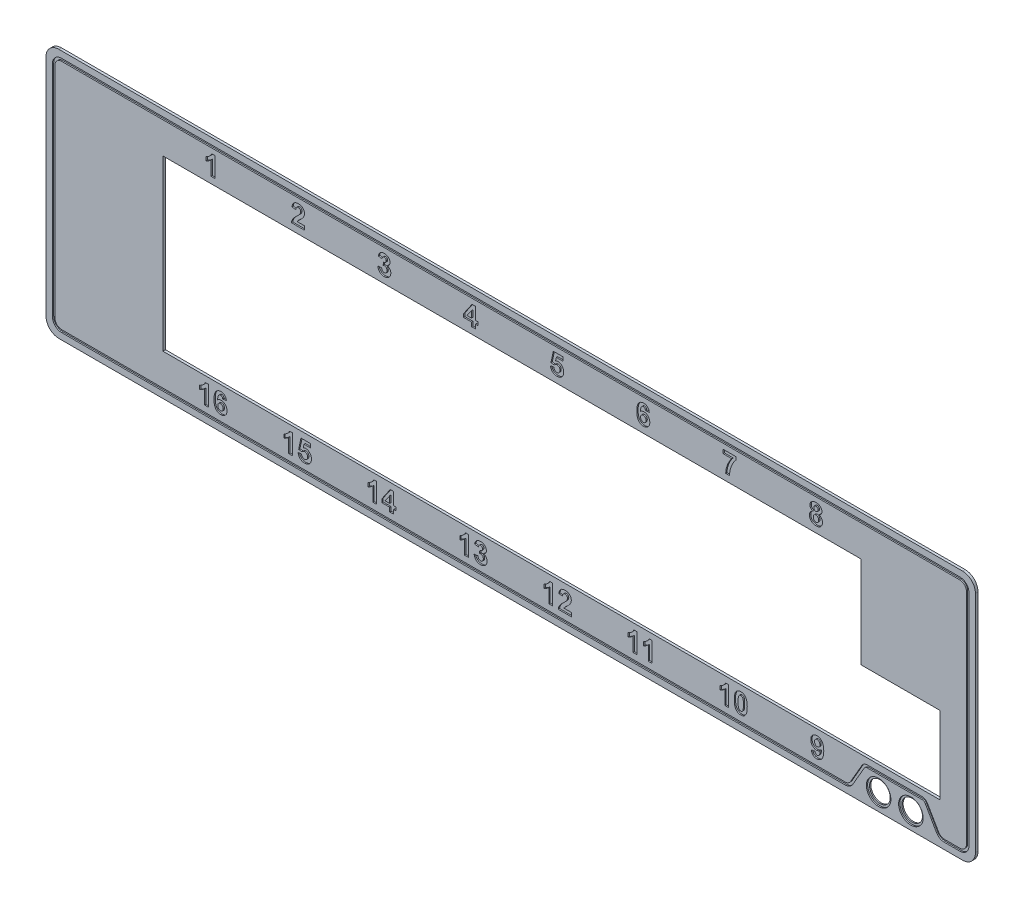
from build123d import *

# Parameters (mm, degrees)
SKETCH1_W               = 144
SKETCH1_H               = 38.8
BOSS_EXTRUDE1_DEPTH     = 0.4
CUT_EXTRUDE1_DEPTH      = 1
SKETCH4_R               = 1.6
CUT_EXTRUDE2_DEPTH      = 1
CUT_EXTRUDE3_DEPTH      = 0.2
CUT_EXTRUDE_THIN1_DEPTH = 1
CUT_EXTRUDE_THIN3_DEPTH = 0.2
FILLET1_R               = 2
CUT_EXTRUDE_THIN4_START = -0.2
SKETCH7_R               = 1.9
SKETCH7_R_2             = 1.6
CUT_EXTRUDE_THIN4_DEPTH = 0.2


with BuildPart() as part:
    # Sketch1 → Boss-Extrude1 (new body)
    with BuildSketch(Plane.XY):
        with Locations((-22.768283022, -24.482208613)):
            Rectangle(SKETCH1_W, SKETCH1_H)
    extrude(amount=BOSS_EXTRUDE1_DEPTH)

    # Sketch2 → Cut-Extrude1 (cut)
    with BuildSketch(Plane.XY):
        Polygon((-76.468283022, -37.332208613), (-76.468283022, -11.532208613), (31.331716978, -11.532208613), (31.331716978, -25.732208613), (43.531716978, -25.732208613), (43.531716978, -37.332208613), align=None)
    extrude(amount=CUT_EXTRUDE1_DEPTH, mode=Mode.SUBTRACT)

    # Sketch4 → Cut-Extrude2 (cut)
    with BuildSketch(Plane.XY):
        with Locations((34.231716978, -41.282208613)):
            Circle(SKETCH4_R)
        with Locations((39.231716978, -41.282208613)):
            Circle(SKETCH4_R)
    extrude(amount=CUT_EXTRUDE2_DEPTH, mode=Mode.SUBTRACT)

    # Sketch3 → Cut-Extrude3 (cut)
    # profile 1 of 23: a face of its own
    with BuildSketch(Plane.XY.offset(0.4)):
        with BuildLine():
            Line((-68.608754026, -10.332208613), (-69.201442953, -10.332208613))
            Line((-69.201442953, -10.332208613), (-69.201442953, -8.138024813))
            add(Edge.make_bspline(
                [(-69.201442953, -8.138024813), (-69.228306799, -8.165296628), (-69.281670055, -8.219470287), (-69.36689958, -8.295035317), (-69.455380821, -8.365330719), (-69.547989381, -8.429688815), (-69.64351463, -8.489026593), (-69.742932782, -8.542875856), (-69.845523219, -8.591981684), (-69.916592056, -8.619424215), (-69.952182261, -8.633167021)],
                knots=[0, 0, 0, 0, 1.012567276, 2.011397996, 3.011400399, 4.000747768, 4.993445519, 5.985067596, 6.990952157, 8, 8, 8, 8], degree=3))
            Line((-69.952182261, -8.633167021), (-69.952182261, -8.040478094))
            add(Edge.make_bspline(
                [(-69.952182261, -8.040478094), (-69.912710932, -8.025678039), (-69.830100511, -7.994702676), (-69.708195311, -7.928816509), (-69.580953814, -7.847242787), (-69.474063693, -7.767237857), (-69.389197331, -7.69610708), (-69.329882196, -7.638929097), (-69.274923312, -7.580375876), (-69.226386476, -7.518557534), (-69.182997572, -7.454723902), (-69.144553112, -7.388979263), (-69.110713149, -7.321115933), (-69.092998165, -7.273857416), (-69.084139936, -7.250226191)],
                knots=[0, 0, 0, 0, 1.253673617, 2.623841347, 4.114270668, 5.751233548, 6.594491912, 7.409089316, 8.202422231, 8.983165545, 9.746111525, 10.498431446, 11.249153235, 12, 12, 12, 12], degree=3))
            Line((-69.084139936, -7.250226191), (-68.608754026, -7.250226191))
            Line((-68.608754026, -7.250226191), (-68.608754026, -10.332208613))
        make_face()
    # profile 2 of 23: a face of its own
    with BuildSketch(Plane.XY.offset(0.4)):
        with BuildLine():
            Line((-54.719483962, -9.739519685), (-54.719483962, -10.332208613))
            Line((-54.719483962, -10.332208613), (-56.734626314, -10.332208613))
            add(Edge.make_bspline(
                [(-56.734626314, -10.332208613), (-56.727803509, -10.281554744), (-56.714161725, -10.18027541), (-56.671986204, -10.032331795), (-56.61569633, -9.887964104), (-56.554604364, -9.770483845), (-56.493841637, -9.67591628), (-56.438711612, -9.598426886), (-56.372943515, -9.515981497), (-56.297491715, -9.427914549), (-56.212773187, -9.333950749), (-56.118155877, -9.234439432), (-56.013188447, -9.129856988), (-55.93934199, -9.058840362), (-55.90115751, -9.02211913)],
                knots=[0, 0, 0, 0, 1.156289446, 2.311930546, 3.473459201, 4.661751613, 5.303057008, 6.018253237, 6.81459331, 7.690699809, 8.644447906, 9.679642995, 10.800191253, 12, 12, 12, 12], degree=3))
            add(Edge.make_bspline(
                [(-55.90115751, -9.02211913), (-55.870685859, -8.992705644), (-55.812676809, -8.936711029), (-55.730071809, -8.85652901), (-55.657453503, -8.782818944), (-55.593303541, -8.717490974), (-55.539103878, -8.658881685), (-55.494141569, -8.607911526), (-55.45784717, -8.564372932), (-55.438190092, -8.536752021), (-55.429475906, -8.524507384)],
                knots=[0, 0, 0, 0, 1.480720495, 2.818855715, 4.024636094, 5.098235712, 6.019786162, 6.815086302, 7.474715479, 8, 8, 8, 8], degree=3))
            add(Edge.make_bspline(
                [(-55.429475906, -8.524507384), (-55.411631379, -8.494865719), (-55.377211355, -8.437690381), (-55.339466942, -8.347781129), (-55.316811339, -8.257890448), (-55.313702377, -8.19782601), (-55.312172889, -8.168276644)],
                knots=[0, 0, 0, 0, 1.0911822, 2.104764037, 3.067617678, 4, 4, 4, 4], degree=3))
            add(Edge.make_bspline(
                [(-55.312172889, -8.168276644), (-55.313282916, -8.137526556), (-55.315383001, -8.079349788), (-55.332992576, -7.997251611), (-55.3642203, -7.926676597), (-55.40721513, -7.867408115), (-55.461582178, -7.820971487), (-55.525138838, -7.786659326), (-55.598815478, -7.767689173), (-55.650599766, -7.765194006), (-55.677664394, -7.763889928)],
                knots=[0, 0, 0, 0, 1.193122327, 2.257294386, 3.237245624, 4.168877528, 5.075331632, 5.990371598, 6.949684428, 8, 8, 8, 8], degree=3))
            add(Edge.make_bspline(
                [(-55.677664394, -7.763889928), (-55.704546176, -7.76510784), (-55.756475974, -7.767460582), (-55.830279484, -7.788013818), (-55.894843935, -7.823593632), (-55.940855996, -7.864140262), (-55.971939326, -7.903568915), (-55.993118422, -7.937928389), (-56.01137315, -7.976971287), (-56.027548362, -8.020258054), (-56.040324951, -8.068284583), (-56.050614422, -8.120685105), (-56.058906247, -8.177741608), (-56.061543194, -8.217434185), (-56.062912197, -8.23804107)],
                knots=[0, 0, 0, 0, 1.402788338, 2.709884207, 3.961032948, 5.225417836, 5.883680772, 6.578928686, 7.329201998, 8.132101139, 8.990263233, 9.922304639, 10.921339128, 12, 12, 12, 12], degree=3))
            Line((-56.062912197, -8.23804107), (-56.655601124, -8.180006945))
            add(Edge.make_bspline(
                [(-56.655601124, -8.180006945), (-56.650835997, -8.139992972), (-56.641597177, -8.062412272), (-56.618541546, -7.950979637), (-56.589342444, -7.848178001), (-56.552607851, -7.754198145), (-56.509856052, -7.668442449), (-56.458906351, -7.592197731), (-56.401538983, -7.524619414), (-56.33770437, -7.465743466), (-56.26780833, -7.415382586), (-56.194464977, -7.370427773), (-56.116240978, -7.333550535), (-56.033997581, -7.303158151), (-55.947771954, -7.2788688), (-55.857165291, -7.262809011), (-55.762736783, -7.251512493), (-55.69827949, -7.250661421), (-55.665316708, -7.250226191)],
                knots=[0, 0, 0, 0, 1.270971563, 2.464210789, 3.586263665, 4.638946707, 5.643716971, 6.603612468, 7.52484387, 8.434700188, 9.336036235, 10.239171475, 11.145359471, 12.059630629, 13.003312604, 13.96741569, 14.960557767, 16, 16, 16, 16], degree=3))
            add(Edge.make_bspline(
                [(-55.665316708, -7.250226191), (-55.629481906, -7.250914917), (-55.559689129, -7.252256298), (-55.457804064, -7.263333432), (-55.362090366, -7.282648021), (-55.271711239, -7.308232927), (-55.187594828, -7.342390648), (-55.109040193, -7.383685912), (-55.037283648, -7.433685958), (-54.971255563, -7.489664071), (-54.912231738, -7.551221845), (-54.860532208, -7.616883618), (-54.817218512, -7.686603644), (-54.78087167, -7.759532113), (-54.753884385, -7.836842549), (-54.734220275, -7.917465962), (-54.721182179, -8.001778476), (-54.720056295, -8.059362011), (-54.719483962, -8.088634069)],
                knots=[0, 0, 0, 0, 1.210756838, 2.35810096, 3.457354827, 4.507168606, 5.527358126, 6.519769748, 7.499700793, 8.476517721, 9.440526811, 10.376769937, 11.295256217, 12.209626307, 13.124630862, 14.055668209, 15.011616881, 16, 16, 16, 16], degree=3))
            add(Edge.make_bspline(
                [(-54.719483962, -8.088634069), (-54.720238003, -8.122229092), (-54.721733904, -8.188876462), (-54.736056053, -8.287401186), (-54.757937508, -8.383653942), (-54.790276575, -8.477869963), (-54.831268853, -8.572309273), (-54.884108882, -8.667183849), (-54.945460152, -8.765354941), (-54.993495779, -8.828826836), (-55.018297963, -8.861599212)],
                knots=[0, 0, 0, 0, 0.953409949, 1.89141903, 2.821310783, 3.752688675, 4.715703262, 5.740811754, 6.833515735, 8, 8, 8, 8], degree=3))
            add(Edge.make_bspline(
                [(-55.018297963, -8.861599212), (-55.027672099, -8.873405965), (-55.047749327, -8.898693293), (-55.081905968, -8.937467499), (-55.121490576, -8.979821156), (-55.165944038, -9.026547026), (-55.216734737, -9.075990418), (-55.272035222, -9.130219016), (-55.334278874, -9.186458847), (-55.398748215, -9.246112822), (-55.463497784, -9.304173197), (-55.523011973, -9.359317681), (-55.57707066, -9.408108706), (-55.623156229, -9.45323976), (-55.663979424, -9.491630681), (-55.69806884, -9.52525011), (-55.726062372, -9.55328415), (-55.764635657, -9.596982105), (-55.813715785, -9.656083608), (-55.848245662, -9.712556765), (-55.864731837, -9.739519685)],
                knots=[0, 0, 0, 0, 0.665555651, 1.425465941, 2.280616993, 3.225313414, 4.272635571, 5.410053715, 6.644756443, 7.976022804, 9.288331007, 10.484517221, 11.558462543, 12.503158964, 13.33222979, 14.032602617, 14.617328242, 15.080653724, 16.606167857, 18, 18, 18, 18], degree=3))
            Line((-55.864731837, -9.739519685), (-54.719483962, -9.739519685))
        make_face()
    # profile 3 of 23: a face of its own
    with BuildSketch(Plane.XY.offset(0.4)):
        with BuildLine():
            Line((-43.359019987, -9.456757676), (-42.76633106, -9.383906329))
            add(Edge.make_bspline(
                [(-42.76633106, -9.383906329), (-42.761212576, -9.420349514), (-42.751496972, -9.489523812), (-42.721203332, -9.585269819), (-42.6816565, -9.668589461), (-42.629298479, -9.736857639), (-42.568763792, -9.791152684), (-42.501253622, -9.829894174), (-42.427378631, -9.854325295), (-42.375923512, -9.856794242), (-42.349596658, -9.858057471)],
                knots=[0, 0, 0, 0, 1.26631894, 2.403651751, 3.447242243, 4.428907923, 5.348362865, 6.231623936, 7.095215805, 8, 8, 8, 8], degree=3))
            add(Edge.make_bspline(
                [(-42.349596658, -9.858057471), (-42.335374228, -9.857752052), (-42.307201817, -9.857147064), (-42.265787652, -9.850799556), (-42.225995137, -9.840365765), (-42.188216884, -9.825352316), (-42.152272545, -9.806697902), (-42.117688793, -9.784483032), (-42.085918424, -9.756737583), (-42.054900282, -9.726381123), (-42.027374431, -9.691825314), (-42.003127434, -9.654333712), (-41.981843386, -9.614278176), (-41.965346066, -9.570625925), (-41.952432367, -9.524322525), (-41.943200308, -9.475166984), (-41.937581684, -9.42334459), (-41.936909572, -9.387830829), (-41.936566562, -9.36970649)],
                knots=[0, 0, 0, 0, 0.951760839, 1.885289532, 2.797832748, 3.70117291, 4.60103766, 5.506897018, 6.445598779, 7.420035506, 8.410036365, 9.396193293, 10.407074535, 11.440988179, 12.514285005, 13.622404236, 14.786601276, 16, 16, 16, 16], degree=3))
            add(Edge.make_bspline(
                [(-41.936566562, -9.36970649), (-41.937851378, -9.336068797), (-41.940302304, -9.27190123), (-41.959241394, -9.180864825), (-41.992085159, -9.100840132), (-42.038100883, -9.033262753), (-42.092780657, -8.978901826), (-42.154033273, -8.938039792), (-42.222437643, -8.914564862), (-42.269991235, -8.911370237), (-42.294032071, -8.909755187)],
                knots=[0, 0, 0, 0, 1.241512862, 2.368321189, 3.414110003, 4.41529485, 5.36642979, 6.245396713, 7.112955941, 8, 8, 8, 8], degree=3))
            add(Edge.make_bspline(
                [(-42.294032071, -8.909755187), (-42.311147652, -8.910193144), (-42.347430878, -8.911121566), (-42.403867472, -8.920767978), (-42.465411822, -8.934080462), (-42.507318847, -8.946886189), (-42.529255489, -8.953589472)],
                knots=[0, 0, 0, 0, 0.854525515, 1.811503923, 2.854410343, 4, 4, 4, 4], degree=3))
            Line((-42.529255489, -8.953589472), (-42.473690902, -8.475116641))
            add(Edge.make_bspline(
                [(-42.473690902, -8.475116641), (-42.457220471, -8.475399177), (-42.425259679, -8.475947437), (-42.378587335, -8.47207787), (-42.334900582, -8.465012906), (-42.294301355, -8.453550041), (-42.256751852, -8.439643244), (-42.221923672, -8.422170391), (-42.190668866, -8.400426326), (-42.152614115, -8.367603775), (-42.113680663, -8.318421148), (-42.07848236, -8.250980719), (-42.058870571, -8.174084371), (-42.056389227, -8.12022673), (-42.055104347, -8.092338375)],
                knots=[0, 0, 0, 0, 0.916749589, 1.778948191, 2.604102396, 3.376994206, 4.124053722, 4.831292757, 5.54010828, 6.238660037, 7.62386988, 9.002523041, 10.447858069, 12, 12, 12, 12], degree=3))
            add(Edge.make_bspline(
                [(-42.055104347, -8.092338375), (-42.055970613, -8.068590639), (-42.057631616, -8.023056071), (-42.072531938, -7.958262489), (-42.097963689, -7.901057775), (-42.1335369, -7.852434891), (-42.177173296, -7.812951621), (-42.228177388, -7.783776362), (-42.286597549, -7.766763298), (-42.327669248, -7.764871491), (-42.348979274, -7.763889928)],
                knots=[0, 0, 0, 0, 1.146968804, 2.199229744, 3.192297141, 4.153502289, 5.090509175, 6.0173182, 6.971286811, 8, 8, 8, 8], degree=3))
            add(Edge.make_bspline(
                [(-42.348979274, -7.763889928), (-42.370342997, -7.764946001), (-42.412336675, -7.767021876), (-42.47242658, -7.787555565), (-42.52786274, -7.819326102), (-42.576781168, -7.864824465), (-42.61917983, -7.921412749), (-42.652035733, -7.990426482), (-42.675174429, -8.07078443), (-42.683126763, -8.128621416), (-42.68730587, -8.159015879)],
                knots=[0, 0, 0, 0, 0.889956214, 1.749345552, 2.62404616, 3.543272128, 4.520224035, 5.562553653, 6.719074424, 8, 8, 8, 8], degree=3))
            Line((-42.68730587, -8.159015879), (-43.279994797, -8.07011254))
            add(Edge.make_bspline(
                [(-43.279994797, -8.07011254), (-43.270222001, -8.024862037), (-43.251514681, -7.938242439), (-43.213292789, -7.816881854), (-43.168445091, -7.709748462), (-43.116047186, -7.61564169), (-43.053980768, -7.532904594), (-42.980288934, -7.461088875), (-42.89607424, -7.398110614), (-42.801497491, -7.345340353), (-42.698665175, -7.303044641), (-42.58922672, -7.271740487), (-42.473461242, -7.253800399), (-42.394315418, -7.251434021), (-42.353918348, -7.250226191)],
                knots=[0, 0, 0, 0, 1.220808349, 2.336900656, 3.3513467, 4.279992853, 5.171472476, 6.069835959, 6.985198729, 7.938095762, 8.919113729, 9.91246339, 10.934493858, 12, 12, 12, 12], degree=3))
            add(Edge.make_bspline(
                [(-42.353918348, -7.250226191), (-42.319302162, -7.251013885), (-42.251668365, -7.252552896), (-42.15304226, -7.265795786), (-42.059725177, -7.287309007), (-41.97158703, -7.31774095), (-41.888219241, -7.356487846), (-41.811013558, -7.405237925), (-41.73835034, -7.461508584), (-41.695311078, -7.505300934), (-41.67356085, -7.527431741)],
                knots=[0, 0, 0, 0, 1.096978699, 2.143298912, 3.148181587, 4.128190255, 5.094201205, 6.055441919, 7.017302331, 8, 8, 8, 8], degree=3))
            add(Edge.make_bspline(
                [(-41.67356085, -7.527431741), (-41.656760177, -7.546290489), (-41.623577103, -7.583538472), (-41.580493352, -7.643256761), (-41.54443457, -7.705309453), (-41.513847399, -7.768401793), (-41.491100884, -7.833996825), (-41.474143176, -7.901064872), (-41.464070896, -7.970200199), (-41.462968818, -8.016985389), (-41.46241542, -8.040478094)],
                knots=[0, 0, 0, 0, 1.065582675, 2.104636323, 3.101288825, 4.092056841, 5.059084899, 6.026073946, 7.008813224, 8, 8, 8, 8], degree=3))
            add(Edge.make_bspline(
                [(-41.46241542, -8.040478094), (-41.463622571, -8.073522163), (-41.466002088, -8.1386581), (-41.487837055, -8.233411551), (-41.522931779, -8.322983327), (-41.571457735, -8.407715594), (-41.634724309, -8.486822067), (-41.712607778, -8.559590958), (-41.802819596, -8.628799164), (-41.87062335, -8.667892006), (-41.905697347, -8.688114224)],
                knots=[0, 0, 0, 0, 0.957571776, 1.887550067, 2.804499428, 3.740591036, 4.709432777, 5.731457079, 6.826512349, 8, 8, 8, 8], degree=3))
            add(Edge.make_bspline(
                [(-41.905697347, -8.688114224), (-41.884826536, -8.693144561), (-41.843641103, -8.703071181), (-41.784143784, -8.723308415), (-41.728424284, -8.749267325), (-41.675117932, -8.777790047), (-41.625547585, -8.811612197), (-41.578752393, -8.849089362), (-41.536521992, -8.892386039), (-41.49605581, -8.938129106), (-41.460683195, -8.988330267), (-41.428721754, -9.040569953), (-41.403049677, -9.096122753), (-41.381092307, -9.153560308), (-41.364731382, -9.213811), (-41.351919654, -9.276424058), (-41.345497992, -9.341789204), (-41.344421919, -9.386159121), (-41.343877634, -9.408601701)],
                knots=[0, 0, 0, 0, 1.037381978, 2.047118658, 3.030848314, 4.005687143, 4.965748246, 5.927353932, 6.897971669, 7.885165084, 8.876109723, 9.862099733, 10.840989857, 11.829385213, 12.830906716, 13.855042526, 14.915067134, 16, 16, 16, 16], degree=3))
            add(Edge.make_bspline(
                [(-41.343877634, -9.408601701), (-41.344569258, -9.441380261), (-41.345933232, -9.506023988), (-41.360914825, -9.6008978), (-41.383676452, -9.692077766), (-41.415043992, -9.779932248), (-41.456993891, -9.863386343), (-41.507157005, -9.943610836), (-41.566899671, -10.019806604), (-41.635025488, -10.091396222), (-41.709464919, -10.156920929), (-41.789449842, -10.214475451), (-41.873795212, -10.263188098), (-41.962984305, -10.303019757), (-42.056241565, -10.334011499), (-42.154369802, -10.355311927), (-42.256573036, -10.369522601), (-42.326498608, -10.370981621), (-42.361944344, -10.371721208)],
                knots=[0, 0, 0, 0, 1.006520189, 1.984993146, 2.943645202, 3.891894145, 4.845023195, 5.808336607, 6.795092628, 7.815033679, 8.841288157, 9.838185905, 10.83832808, 11.829129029, 12.835072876, 13.85234392, 14.911338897, 16, 16, 16, 16], degree=3))
            add(Edge.make_bspline(
                [(-42.361944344, -10.371721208), (-42.395534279, -10.37115807), (-42.461512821, -10.370051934), (-42.558099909, -10.356947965), (-42.650608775, -10.337670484), (-42.73849946, -10.309469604), (-42.82253756, -10.274734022), (-42.90113689, -10.229956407), (-42.976320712, -10.179062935), (-43.0456327, -10.119445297), (-43.110077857, -10.054468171), (-43.166685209, -9.98301148), (-43.217129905, -9.907355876), (-43.260517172, -9.826830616), (-43.296483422, -9.741226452), (-43.324488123, -9.650764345), (-43.346822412, -9.555721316), (-43.354898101, -9.490200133), (-43.359019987, -9.456757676)],
                knots=[0, 0, 0, 0, 1.077528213, 2.11651914, 3.123276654, 4.10732375, 5.075386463, 6.036572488, 7.005896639, 7.98540975, 8.966414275, 9.939311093, 10.906719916, 11.882103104, 12.870994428, 13.882228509, 14.919075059, 16, 16, 16, 16], degree=3))
        make_face()
    # profile 4 of 23: a face of its own
    with BuildSketch(Plane.XY.offset(0.4)):
        Polygon((-28.8375484, -10.332208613), (-28.8375484, -9.70000709), (-30.06243885, -9.70000709), (-30.06243885, -9.188195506), (-28.759140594, -7.289738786), (-28.244859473, -7.289738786), (-28.244859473, -9.186343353), (-27.849733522, -9.186343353), (-27.849733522, -9.70000709), (-28.244859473, -9.70000709), (-28.244859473, -10.332208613), align=None)
        Polygon((-28.8375484, -9.186343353), (-28.8375484, -8.160250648), (-29.54260127, -9.186343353), align=None, mode=Mode.SUBTRACT)
    # profile 5 of 23: a face of its own
    with BuildSketch(Plane.XY.offset(0.4)):
        with BuildLine():
            Line((-16.607807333, -9.450583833), (-16.094143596, -9.383906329))
            add(Edge.make_bspline(
                [(-16.094143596, -9.383906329), (-16.088461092, -9.418741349), (-16.077518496, -9.48582192), (-16.043549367, -9.579471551), (-15.996242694, -9.661973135), (-15.935444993, -9.731442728), (-15.866249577, -9.78794179), (-15.789806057, -9.828220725), (-15.708429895, -9.853580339), (-15.652071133, -9.856558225), (-15.62369676, -9.858057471)],
                knots=[0, 0, 0, 0, 1.154848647, 2.223851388, 3.245409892, 4.254330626, 5.232966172, 6.156270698, 7.071756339, 8, 8, 8, 8], degree=3))
            add(Edge.make_bspline(
                [(-15.62369676, -9.858057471), (-15.60721264, -9.857767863), (-15.574944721, -9.857200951), (-15.527393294, -9.85076577), (-15.481968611, -9.840310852), (-15.438240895, -9.826121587), (-15.396665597, -9.807459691), (-15.357205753, -9.784622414), (-15.319713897, -9.757577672), (-15.284000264, -9.726997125), (-15.25100058, -9.692082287), (-15.22342108, -9.651892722), (-15.19898913, -9.608482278), (-15.179085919, -9.560671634), (-15.164738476, -9.508293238), (-15.153324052, -9.452243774), (-15.147505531, -9.391846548), (-15.146407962, -9.350371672), (-15.145841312, -9.328959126)],
                knots=[0, 0, 0, 0, 0.981268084, 1.920847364, 2.851509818, 3.754644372, 4.654445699, 5.560569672, 6.465366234, 7.403985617, 8.358004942, 9.316972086, 10.299158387, 11.321223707, 12.392031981, 13.529051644, 14.724304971, 16, 16, 16, 16], degree=3))
            add(Edge.make_bspline(
                [(-15.145841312, -9.328959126), (-15.146161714, -9.30877528), (-15.146780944, -9.269766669), (-15.152525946, -9.213249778), (-15.161344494, -9.160434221), (-15.175373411, -9.111706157), (-15.191395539, -9.066159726), (-15.212997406, -9.025409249), (-15.236700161, -8.987684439), (-15.265590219, -8.955020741), (-15.297068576, -8.926160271), (-15.330592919, -8.900446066), (-15.366539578, -8.878990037), (-15.404550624, -8.860574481), (-15.445284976, -8.847160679), (-15.488412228, -8.838236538), (-15.533352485, -8.831537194), (-15.564195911, -8.831001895), (-15.579862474, -8.830729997)],
                knots=[0, 0, 0, 0, 1.29221626, 2.497420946, 3.635005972, 4.715822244, 5.741640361, 6.720139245, 7.663294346, 8.588224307, 9.502291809, 10.395891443, 11.288713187, 12.178904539, 13.095818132, 14.026458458, 14.997562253, 16, 16, 16, 16], degree=3))
            add(Edge.make_bspline(
                [(-15.579862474, -8.830729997), (-15.599669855, -8.831440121), (-15.639185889, -8.832856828), (-15.697518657, -8.844373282), (-15.754296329, -8.863122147), (-15.809459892, -8.889221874), (-15.862863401, -8.922881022), (-15.914275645, -8.964211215), (-15.964579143, -9.01250137), (-15.99547847, -9.048988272), (-16.0114141, -9.067805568)],
                knots=[0, 0, 0, 0, 0.931687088, 1.85873035, 2.786835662, 3.740075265, 4.723687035, 5.750832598, 6.840042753, 8, 8, 8, 8], degree=3))
            Line((-16.0114141, -9.067805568), (-16.528782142, -8.99495422))
            Line((-16.528782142, -8.99495422), (-16.173168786, -7.289738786))
            Line((-16.173168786, -7.289738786), (-14.67169017, -7.289738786))
            Line((-14.67169017, -7.289738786), (-14.67169017, -7.882427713))
            Line((-14.67169017, -7.882427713), (-15.697782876, -7.882427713))
            Line((-15.697782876, -7.882427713), (-15.818790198, -8.432517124))
            add(Edge.make_bspline(
                [(-15.818790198, -8.432517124), (-15.787954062, -8.414725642), (-15.727903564, -8.380078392), (-15.632032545, -8.344412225), (-15.535669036, -8.321521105), (-15.470709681, -8.318543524), (-15.43848147, -8.31706626)],
                knots=[0, 0, 0, 0, 1.060051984, 2.064352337, 3.039669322, 4, 4, 4, 4], degree=3))
            add(Edge.make_bspline(
                [(-15.43848147, -8.31706626), (-15.408184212, -8.31788157), (-15.348335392, -8.319492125), (-15.260562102, -8.332706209), (-15.17637083, -8.354484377), (-15.095477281, -8.384790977), (-15.018460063, -8.424515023), (-14.944655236, -8.472527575), (-14.875128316, -8.529661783), (-14.809132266, -8.594268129), (-14.748948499, -8.665747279), (-14.696975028, -8.743691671), (-14.652084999, -8.826159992), (-14.615539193, -8.914063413), (-14.588019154, -9.007524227), (-14.567409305, -9.10573766), (-14.555863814, -9.209323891), (-14.554068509, -9.279952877), (-14.553152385, -9.315994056)],
                knots=[0, 0, 0, 0, 0.974409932, 1.924837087, 2.848242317, 3.768103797, 4.697919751, 5.630842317, 6.595644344, 7.588240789, 8.59876155, 9.595918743, 10.597287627, 11.615415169, 12.652315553, 13.727511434, 14.840374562, 16, 16, 16, 16], degree=3))
            add(Edge.make_bspline(
                [(-14.553152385, -9.315994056), (-14.553979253, -9.346265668), (-14.55562042, -9.406348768), (-14.565219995, -9.495259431), (-14.583140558, -9.581551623), (-14.605968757, -9.665711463), (-14.637517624, -9.747033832), (-14.674956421, -9.826048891), (-14.719710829, -9.902614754), (-14.754239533, -9.950922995), (-14.771706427, -9.975360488)],
                knots=[0, 0, 0, 0, 1.027524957, 2.039431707, 3.02972907, 4.015954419, 4.995255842, 5.985553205, 6.980960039, 8, 8, 8, 8], degree=3))
            add(Edge.make_bspline(
                [(-14.771706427, -9.975360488), (-14.797169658, -10.006827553), (-14.847284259, -10.068758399), (-14.933073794, -10.150182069), (-15.026380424, -10.218563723), (-15.126951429, -10.274722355), (-15.234679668, -10.318791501), (-15.350051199, -10.349430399), (-15.472220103, -10.368386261), (-15.556125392, -10.370593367), (-15.599001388, -10.371721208)],
                knots=[0, 0, 0, 0, 1.018121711, 2.003781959, 2.967346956, 3.92281574, 4.896313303, 5.889026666, 6.921282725, 8, 8, 8, 8], degree=3))
            add(Edge.make_bspline(
                [(-15.599001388, -10.371721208), (-15.633610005, -10.371096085), (-15.701185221, -10.369875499), (-15.800147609, -10.357804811), (-15.893931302, -10.338194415), (-15.98312797, -10.310981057), (-16.067207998, -10.275637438), (-16.14682467, -10.232966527), (-16.221314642, -10.182022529), (-16.290334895, -10.123190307), (-16.353714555, -10.058163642), (-16.410246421, -9.987012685), (-16.460544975, -9.910927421), (-16.503650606, -9.82913904), (-16.540386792, -9.742221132), (-16.569637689, -9.649728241), (-16.593721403, -9.552277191), (-16.603060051, -9.48485683), (-16.607807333, -9.450583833)],
                knots=[0, 0, 0, 0, 1.098912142, 2.145685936, 3.161086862, 4.139124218, 5.10307886, 6.053641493, 7.003731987, 7.963777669, 8.929946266, 9.883471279, 10.846206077, 11.822909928, 12.81603559, 13.839338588, 14.901632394, 16, 16, 16, 16], degree=3))
        make_face()
    # profile 6 of 23: a face of its own
    with BuildSketch(Plane.XY.offset(0.4)):
        with BuildLine():
            Line((-1.296083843, -8.054677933), (-1.88877277, -8.119503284))
            add(Edge.make_bspline(
                [(-1.88877277, -8.119503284), (-1.892743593, -8.090956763), (-1.900215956, -8.037237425), (-1.922348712, -7.963104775), (-1.953160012, -7.900740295), (-1.992709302, -7.850056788), (-2.039816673, -7.811048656), (-2.093492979, -7.783331), (-2.153704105, -7.766877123), (-2.195918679, -7.764910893), (-2.217838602, -7.763889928)],
                knots=[0, 0, 0, 0, 1.280716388, 2.410074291, 3.425374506, 4.35753932, 5.248331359, 6.12451615, 7.026154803, 8, 8, 8, 8], degree=3))
            add(Edge.make_bspline(
                [(-2.217838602, -7.763889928), (-2.232703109, -7.764253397), (-2.262282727, -7.764976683), (-2.305369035, -7.774159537), (-2.346909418, -7.787786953), (-2.386564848, -7.807087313), (-2.424533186, -7.831990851), (-2.460237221, -7.862795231), (-2.495318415, -7.897876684), (-2.527711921, -7.940239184), (-2.55878972, -7.990399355), (-2.585548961, -8.051804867), (-2.609399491, -8.124398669), (-2.629820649, -8.208536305), (-2.64835264, -8.303683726), (-2.663543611, -8.410226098), (-2.675699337, -8.528259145), (-2.681530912, -8.610921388), (-2.684581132, -8.654158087)],
                knots=[0, 0, 0, 0, 0.642458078, 1.278459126, 1.898279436, 2.531842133, 3.181731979, 3.858193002, 4.57010051, 5.325711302, 6.161524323, 7.118599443, 8.217371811, 9.466325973, 10.864147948, 12.412648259, 14.123626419, 16, 16, 16, 16], degree=3))
            add(Edge.make_bspline(
                [(-2.684581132, -8.654158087), (-2.665638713, -8.633584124), (-2.628494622, -8.593240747), (-2.566860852, -8.540642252), (-2.502290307, -8.495674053), (-2.434080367, -8.458781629), (-2.36185872, -8.431327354), (-2.286933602, -8.410481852), (-2.208324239, -8.398805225), (-2.154901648, -8.397007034), (-2.127700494, -8.39609145)],
                knots=[0, 0, 0, 0, 1.057745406, 2.074127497, 3.059409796, 4.031705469, 5.000875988, 5.977809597, 6.970362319, 8, 8, 8, 8], degree=3))
            add(Edge.make_bspline(
                [(-2.127700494, -8.39609145), (-2.097001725, -8.396975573), (-2.036382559, -8.398721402), (-1.947076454, -8.410966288), (-1.861381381, -8.432984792), (-1.778909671, -8.462770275), (-1.699253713, -8.500277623), (-1.623937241, -8.547756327), (-1.551777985, -8.603114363), (-1.483768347, -8.666360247), (-1.421283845, -8.735988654), (-1.366116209, -8.81119284), (-1.320715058, -8.892202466), (-1.281902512, -8.977203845), (-1.253024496, -9.067874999), (-1.232062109, -9.162911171), (-1.219549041, -9.263184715), (-1.217901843, -9.331598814), (-1.217058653, -9.366619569)],
                knots=[0, 0, 0, 0, 0.99135015, 1.957564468, 2.903754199, 3.843479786, 4.78583385, 5.741106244, 6.712813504, 7.719198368, 8.735844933, 9.730198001, 10.724351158, 11.729813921, 12.742848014, 13.790983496, 14.86921809, 16, 16, 16, 16], degree=3))
            add(Edge.make_bspline(
                [(-1.217058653, -9.366619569), (-1.21791415, -9.403693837), (-1.219582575, -9.475997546), (-1.231863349, -9.581888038), (-1.253556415, -9.68183674), (-1.283193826, -9.776645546), (-1.321528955, -9.865563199), (-1.367968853, -9.949322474), (-1.424085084, -10.026491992), (-1.487330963, -10.098109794), (-1.557837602, -10.162019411), (-1.632977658, -10.21861213), (-1.713584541, -10.265656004), (-1.798466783, -10.30525148), (-1.889082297, -10.334309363), (-1.983833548, -10.356101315), (-2.083490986, -10.369392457), (-2.151531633, -10.370932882), (-2.186352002, -10.371721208)],
                knots=[0, 0, 0, 0, 1.13287417, 2.209376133, 3.25169942, 4.254157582, 5.240146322, 6.205890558, 7.174579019, 8.150183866, 9.1206468, 10.07783463, 11.019441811, 11.967766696, 12.934309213, 13.921380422, 14.936249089, 16, 16, 16, 16], degree=3))
            add(Edge.make_bspline(
                [(-2.186352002, -10.371721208), (-2.223661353, -10.370677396), (-2.297018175, -10.368625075), (-2.404404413, -10.351735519), (-2.506498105, -10.323161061), (-2.603286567, -10.283255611), (-2.695574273, -10.233060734), (-2.782504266, -10.170709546), (-2.863846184, -10.096796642), (-2.940675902, -10.012322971), (-3.010588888, -9.914749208), (-3.070127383, -9.801974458), (-3.120621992, -9.675233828), (-3.161732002, -9.534202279), (-3.193465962, -9.378890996), (-3.2156092, -9.209286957), (-3.230316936, -9.025670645), (-3.231558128, -8.898467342), (-3.232201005, -8.83258215)],
                knots=[0, 0, 0, 0, 0.852151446, 1.675481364, 2.476404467, 3.269281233, 4.062617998, 4.871616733, 5.707301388, 6.56955125, 7.476395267, 8.442009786, 9.475854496, 10.58877921, 11.794095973, 13.094195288, 14.494932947, 16, 16, 16, 16], degree=3))
            add(Edge.make_bspline(
                [(-3.232201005, -8.83258215), (-3.231279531, -8.765053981), (-3.22949902, -8.634573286), (-3.215171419, -8.446177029), (-3.192413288, -8.272201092), (-3.159260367, -8.113037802), (-3.11685522, -7.968356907), (-3.065445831, -7.837867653), (-3.003740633, -7.722042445), (-2.931998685, -7.621257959), (-2.853061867, -7.533649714), (-2.76824391, -7.458028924), (-2.677868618, -7.393664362), (-2.581938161, -7.340718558), (-2.479665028, -7.300580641), (-2.372019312, -7.271596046), (-2.258820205, -7.252968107), (-2.181280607, -7.251149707), (-2.141900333, -7.250226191)],
                knots=[0, 0, 0, 0, 1.491699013, 2.882321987, 4.171520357, 5.365488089, 6.470299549, 7.49861535, 8.458736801, 9.361983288, 10.224742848, 11.058789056, 11.867429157, 12.671146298, 13.473202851, 14.288259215, 15.130652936, 16, 16, 16, 16], degree=3))
            add(Edge.make_bspline(
                [(-2.141900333, -7.250226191), (-2.11408462, -7.25072661), (-2.059708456, -7.251704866), (-1.980012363, -7.26209313), (-1.90398303, -7.277978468), (-1.831421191, -7.299967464), (-1.76283773, -7.329414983), (-1.697960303, -7.36528888), (-1.636570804, -7.407491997), (-1.578988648, -7.455752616), (-1.525677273, -7.510216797), (-1.477538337, -7.571007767), (-1.434253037, -7.637391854), (-1.395631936, -7.709313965), (-1.363237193, -7.787462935), (-1.335388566, -7.871224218), (-1.312485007, -7.960777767), (-1.301634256, -8.022900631), (-1.296083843, -8.054677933)],
                knots=[0, 0, 0, 0, 1.036027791, 2.025301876, 2.989435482, 3.928225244, 4.845595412, 5.765526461, 6.686607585, 7.61747015, 8.561102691, 9.521661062, 10.50224679, 11.510949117, 12.559251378, 13.650572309, 14.798212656, 16, 16, 16, 16], degree=3))
        make_face()
        with BuildLine():
            add(Edge.make_bspline(
                [(-2.639512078, -9.353037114), (-2.639287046, -9.372611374), (-2.638847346, -9.410858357), (-2.631637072, -9.466357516), (-2.621272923, -9.518386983), (-2.607312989, -9.567235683), (-2.587963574, -9.612164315), (-2.565007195, -9.654074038), (-2.537852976, -9.6925851), (-2.496188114, -9.737769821), (-2.438615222, -9.785227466), (-2.363059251, -9.827488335), (-2.282103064, -9.853758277), (-2.226262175, -9.856615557), (-2.198082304, -9.858057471)],
                knots=[0, 0, 0, 0, 0.93816693, 1.833124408, 2.679057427, 3.481731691, 4.264557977, 5.020023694, 5.770442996, 6.518065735, 7.962605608, 9.32780964, 10.651490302, 12, 12, 12, 12], degree=3))
            add(Edge.make_bspline(
                [(-2.198082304, -9.858057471), (-2.171387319, -9.856859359), (-2.119428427, -9.854527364), (-2.04522991, -9.833214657), (-1.977831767, -9.799602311), (-1.928423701, -9.760141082), (-1.893972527, -9.721760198), (-1.870822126, -9.688101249), (-1.851977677, -9.649704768), (-1.836571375, -9.607203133), (-1.824161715, -9.560760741), (-1.815689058, -9.509910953), (-1.810883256, -9.45479303), (-1.810135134, -9.416637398), (-1.80974758, -9.396871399)],
                knots=[0, 0, 0, 0, 1.399678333, 2.724321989, 4.020062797, 5.33532049, 6.016755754, 6.724441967, 7.473839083, 8.257094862, 9.096253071, 9.995581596, 10.961638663, 12, 12, 12, 12], degree=3))
            add(Edge.make_bspline(
                [(-1.80974758, -9.396871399), (-1.81007816, -9.376484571), (-1.810717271, -9.337070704), (-1.816309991, -9.280104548), (-1.825459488, -9.227441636), (-1.838251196, -9.178709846), (-1.855566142, -9.134561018), (-1.875993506, -9.094104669), (-1.900794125, -9.058437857), (-1.937651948, -9.016489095), (-1.991244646, -8.974220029), (-2.062854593, -8.935719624), (-2.143121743, -8.913893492), (-2.198984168, -8.911160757), (-2.22771675, -8.909755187)],
                knots=[0, 0, 0, 0, 1.008384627, 1.949510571, 2.828269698, 3.650667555, 4.437180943, 5.170285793, 5.887596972, 6.580056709, 7.926803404, 9.238379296, 10.579573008, 12, 12, 12, 12], degree=3))
            add(Edge.make_bspline(
                [(-2.22771675, -8.909755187), (-2.255652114, -8.9108931), (-2.309906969, -8.913103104), (-2.387877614, -8.935296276), (-2.45922156, -8.970609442), (-2.511770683, -9.012095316), (-2.548808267, -9.051194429), (-2.573066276, -9.084484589), (-2.594181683, -9.120729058), (-2.610857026, -9.160865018), (-2.623713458, -9.204139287), (-2.63293455, -9.250847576), (-2.63851455, -9.30083499), (-2.639173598, -9.335323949), (-2.639512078, -9.353037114)],
                knots=[0, 0, 0, 0, 1.469034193, 2.853094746, 4.235454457, 5.641396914, 6.354997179, 7.06867986, 7.807229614, 8.560602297, 9.353235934, 10.182779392, 11.06669468, 12, 12, 12, 12], degree=3))
        make_face(mode=Mode.SUBTRACT)
    # profile 7 of 23: a face of its own
    with BuildSketch(Plane.XY.offset(0.4)):
        with BuildLine():
            Line((10.143405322, -7.882427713), (10.143405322, -7.289738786))
            Line((10.143405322, -7.289738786), (12.158547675, -7.289738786))
            Line((12.158547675, -7.289738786), (12.158547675, -7.724377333))
            add(Edge.make_bspline(
                [(12.158547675, -7.724377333), (12.137525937, -7.745766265), (12.094311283, -7.789735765), (12.032410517, -7.861696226), (11.969592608, -7.939785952), (11.90717114, -8.025057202), (11.843205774, -8.116162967), (11.780507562, -8.214849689), (11.716917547, -8.319837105), (11.631305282, -8.468342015), (11.531235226, -8.662335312), (11.4253664, -8.903478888), (11.335171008, -9.152028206), (11.273409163, -9.363810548), (11.231679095, -9.533553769), (11.204414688, -9.657674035), (11.181463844, -9.778301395), (11.162793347, -9.895647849), (11.148859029, -10.00976693), (11.137848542, -10.120261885), (11.132416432, -10.227402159), (11.131614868, -10.297630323), (11.131220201, -10.332208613)],
                knots=[0, 0, 0, 0, 0.628545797, 1.29210959, 1.98878689, 2.729126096, 3.507039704, 4.322017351, 5.179550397, 6.080149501, 7.915136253, 9.752312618, 11.597470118, 13.454141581, 14.373891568, 15.261584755, 16.117868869, 16.947726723, 17.752002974, 18.527724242, 19.275094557, 20, 20, 20, 20], degree=3))
            Line((11.131220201, -10.332208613), (10.538531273, -10.332208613))
            add(Edge.make_bspline(
                [(10.538531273, -10.332208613), (10.540513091, -10.279703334), (10.544498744, -10.174109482), (10.559410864, -10.015616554), (10.582831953, -9.856533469), (10.611922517, -9.696492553), (10.650329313, -9.535883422), (10.694163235, -9.374111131), (10.74726144, -9.212039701), (10.806783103, -9.049979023), (10.872491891, -8.889467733), (10.944105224, -8.73249669), (11.021437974, -8.580045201), (11.103484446, -8.431577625), (11.191199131, -8.287571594), (11.284648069, -8.148183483), (11.382505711, -8.012405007), (11.452475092, -7.925746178), (11.487450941, -7.882427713)],
                knots=[0, 0, 0, 0, 0.943249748, 1.896978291, 2.856365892, 3.829648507, 4.816416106, 5.820376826, 6.838120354, 7.877341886, 8.919613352, 9.951365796, 10.974227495, 11.988073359, 12.996274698, 14.000568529, 15.000536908, 16, 16, 16, 16], degree=3))
            Line((11.487450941, -7.882427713), (10.143405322, -7.882427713))
        make_face()
    # profile 8 of 23: a face of its own
    with BuildSketch(Plane.XY.offset(0.4)):
        with BuildLine():
            add(Edge.make_bspline(
                [(24.043170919, -8.656627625), (24.024326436, -8.648648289), (23.987337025, -8.632985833), (23.934819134, -8.605602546), (23.886131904, -8.576398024), (23.842040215, -8.544208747), (23.800717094, -8.511362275), (23.764609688, -8.474510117), (23.73158425, -8.436445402), (23.693911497, -8.382759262), (23.6554809, -8.311892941), (23.622453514, -8.221834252), (23.601924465, -8.127627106), (23.599343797, -8.063218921), (23.598036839, -8.030599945)],
                knots=[0, 0, 0, 0, 0.898135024, 1.762928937, 2.598141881, 3.387992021, 4.158483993, 4.912374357, 5.649344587, 6.368826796, 7.78793972, 9.174346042, 10.568971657, 12, 12, 12, 12], degree=3))
            add(Edge.make_bspline(
                [(23.598036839, -8.030599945), (23.598736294, -8.002988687), (23.600109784, -7.948769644), (23.611291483, -7.869233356), (23.630699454, -7.793391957), (23.657056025, -7.72103095), (23.691349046, -7.652536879), (23.733225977, -7.587976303), (23.781911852, -7.526446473), (23.83903712, -7.469944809), (23.902439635, -7.417742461), (23.973001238, -7.372757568), (24.049966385, -7.334964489), (24.132896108, -7.303160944), (24.222627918, -7.279655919), (24.318350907, -7.262093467), (24.420406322, -7.252576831), (24.490550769, -7.251023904), (24.526582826, -7.250226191)],
                knots=[0, 0, 0, 0, 0.969401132, 1.903571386, 2.813295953, 3.714164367, 4.602979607, 5.497068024, 6.412430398, 7.352730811, 8.313282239, 9.291613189, 10.283859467, 11.320059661, 12.405231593, 13.536450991, 14.734515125, 16, 16, 16, 16], degree=3))
            add(Edge.make_bspline(
                [(24.526582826, -7.250226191), (24.562411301, -7.251008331), (24.631944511, -7.25252625), (24.733354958, -7.262230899), (24.828324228, -7.279457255), (24.917549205, -7.303363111), (25.000217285, -7.335143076), (25.077511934, -7.37237065), (25.147766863, -7.418145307), (25.211670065, -7.46988576), (25.269382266, -7.526438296), (25.318646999, -7.587977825), (25.361277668, -7.652358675), (25.395443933, -7.721053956), (25.421913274, -7.793378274), (25.441050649, -7.869294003), (25.453269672, -7.948708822), (25.454501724, -8.002978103), (25.455128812, -8.030599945)],
                knots=[0, 0, 0, 0, 1.259437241, 2.444221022, 3.576496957, 4.648717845, 5.68588583, 6.685544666, 7.658705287, 8.625770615, 9.572078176, 10.492824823, 11.391686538, 12.281331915, 13.183041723, 14.093615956, 15.029693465, 16, 16, 16, 16], degree=3))
            add(Edge.make_bspline(
                [(25.455128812, -8.030599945), (25.453776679, -8.064893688), (25.451115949, -8.132377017), (25.427909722, -8.230226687), (25.391387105, -8.322648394), (25.338936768, -8.407654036), (25.274002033, -8.485504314), (25.195542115, -8.552946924), (25.106135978, -8.612000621), (25.039709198, -8.641508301), (25.005673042, -8.656627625)],
                knots=[0, 0, 0, 0, 1.001685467, 1.971119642, 2.924446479, 3.896772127, 4.879289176, 5.877460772, 6.912440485, 8, 8, 8, 8], degree=3))
            add(Edge.make_bspline(
                [(25.005673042, -8.656627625), (25.02680138, -8.665378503), (25.068260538, -8.682549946), (25.127176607, -8.713112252), (25.18204893, -8.746589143), (25.233843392, -8.78208235), (25.280573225, -8.8219977), (25.323950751, -8.864002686), (25.363980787, -8.908681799), (25.399392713, -8.956627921), (25.43108217, -9.007028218), (25.458889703, -9.059086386), (25.481812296, -9.113561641), (25.500895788, -9.169438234), (25.515987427, -9.227402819), (25.526045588, -9.28733384), (25.53347342, -9.349148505), (25.533925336, -9.39108598), (25.534154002, -9.412306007)],
                knots=[0, 0, 0, 0, 1.114643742, 2.187213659, 3.231772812, 4.247796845, 5.244764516, 6.224002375, 7.19061506, 8.165938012, 9.126385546, 10.091434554, 11.040068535, 12.004700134, 12.968444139, 13.956586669, 14.966049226, 16, 16, 16, 16], degree=3))
            add(Edge.make_bspline(
                [(25.534154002, -9.412306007), (25.533274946, -9.446910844), (25.531547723, -9.514904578), (25.519431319, -9.614464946), (25.497546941, -9.708853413), (25.467688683, -9.79830706), (25.430456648, -9.883466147), (25.382796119, -9.96268291), (25.327667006, -10.037379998), (25.26419523, -10.106158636), (25.193915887, -10.168470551), (25.117748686, -10.223231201), (25.03555809, -10.26895672), (24.948019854, -10.307093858), (24.854484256, -10.335642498), (24.755606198, -10.35691464), (24.651190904, -10.369162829), (24.579709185, -10.370857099), (24.543252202, -10.371721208)],
                knots=[0, 0, 0, 0, 1.069671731, 2.10175744, 3.09402022, 4.059639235, 5.013663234, 5.960662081, 6.911094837, 7.879078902, 8.847982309, 9.810095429, 10.772776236, 11.750101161, 12.756155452, 13.790512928, 14.873121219, 16, 16, 16, 16], degree=3))
            add(Edge.make_bspline(
                [(24.543252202, -10.371721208), (24.509068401, -10.370931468), (24.442203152, -10.369386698), (24.343901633, -10.359568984), (24.250158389, -10.342377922), (24.160612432, -10.318035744), (24.075150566, -10.28764175), (23.994835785, -10.248659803), (23.917899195, -10.204669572), (23.870977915, -10.16912874), (23.847460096, -10.151315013)],
                knots=[0, 0, 0, 0, 1.102600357, 2.156742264, 3.182669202, 4.172953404, 5.147246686, 6.10327948, 7.049328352, 8, 8, 8, 8], degree=3))
            add(Edge.make_bspline(
                [(23.847460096, -10.151315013), (23.821117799, -10.12932848), (23.769116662, -10.08592586), (23.702834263, -10.010413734), (23.645545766, -9.930011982), (23.599235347, -9.843237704), (23.563108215, -9.750138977), (23.537465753, -9.651329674), (23.521478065, -9.546387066), (23.519848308, -9.474515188), (23.519011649, -9.437618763)],
                knots=[0, 0, 0, 0, 1.009349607, 1.992511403, 2.949479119, 3.912246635, 4.881480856, 5.884237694, 6.913844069, 8, 8, 8, 8], degree=3))
            add(Edge.make_bspline(
                [(23.519011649, -9.437618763), (23.520567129, -9.396760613), (23.523641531, -9.316004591), (23.547808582, -9.197460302), (23.587710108, -9.084389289), (23.633298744, -8.99488664), (23.67819741, -8.927723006), (23.716825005, -8.879784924), (23.760068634, -8.834844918), (23.807589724, -8.792695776), (23.860104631, -8.75423019), (23.917010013, -8.71867711), (23.977887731, -8.684894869), (24.021183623, -8.666147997), (24.043170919, -8.656627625)],
                knots=[0, 0, 0, 0, 1.466730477, 2.898988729, 4.325053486, 5.763136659, 6.492982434, 7.22372602, 7.971323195, 8.73066801, 9.502396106, 10.306304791, 11.139877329, 12, 12, 12, 12], degree=3))
        make_face()
        with BuildLine():
            add(Edge.make_bspline(
                [(24.190725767, -8.076903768), (24.191637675, -8.103553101), (24.193384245, -8.154594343), (24.210808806, -8.226518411), (24.239649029, -8.289343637), (24.279320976, -8.342604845), (24.329625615, -8.38453568), (24.388011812, -8.414566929), (24.454170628, -8.432189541), (24.500543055, -8.434433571), (24.524730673, -8.435604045)],
                knots=[0, 0, 0, 0, 1.15281608, 2.207978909, 3.181172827, 4.129718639, 5.059990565, 5.992992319, 6.953155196, 8, 8, 8, 8], degree=3))
            add(Edge.make_bspline(
                [(24.524730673, -8.435604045), (24.549134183, -8.434473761), (24.596183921, -8.432294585), (24.662853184, -8.414029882), (24.721994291, -8.383847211), (24.772374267, -8.341378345), (24.813061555, -8.288071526), (24.842218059, -8.225116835), (24.859890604, -8.152970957), (24.861561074, -8.101912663), (24.862439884, -8.075051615)],
                knots=[0, 0, 0, 0, 1.048069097, 2.020667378, 2.946900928, 3.882892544, 4.829907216, 5.807806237, 6.846717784, 8, 8, 8, 8], degree=3))
            add(Edge.make_bspline(
                [(24.862439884, -8.075051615), (24.861566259, -8.049615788), (24.859895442, -8.000969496), (24.841839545, -7.932147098), (24.813529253, -7.870782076), (24.772788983, -7.819018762), (24.723900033, -7.775899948), (24.665637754, -7.746264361), (24.600368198, -7.727564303), (24.554295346, -7.725469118), (24.530287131, -7.724377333)],
                knots=[0, 0, 0, 0, 1.120059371, 2.14212559, 3.117108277, 4.081714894, 5.028368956, 5.970787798, 6.942592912, 8, 8, 8, 8], degree=3))
            add(Edge.make_bspline(
                [(24.530287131, -7.724377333), (24.505468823, -7.725478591), (24.458000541, -7.727584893), (24.390654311, -7.745992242), (24.331201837, -7.776597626), (24.28115285, -7.819787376), (24.240411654, -7.872202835), (24.211032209, -7.933370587), (24.193400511, -8.00266571), (24.19164166, -8.051482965), (24.190725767, -8.076903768)],
                knots=[0, 0, 0, 0, 1.078082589, 2.061974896, 3.011033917, 3.963675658, 4.914590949, 5.879605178, 6.895838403, 8, 8, 8, 8], degree=3))
        make_face(mode=Mode.SUBTRACT)
        with BuildLine():
            add(Edge.make_bspline(
                [(24.111700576, -9.381436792), (24.112025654, -9.401208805), (24.112656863, -9.439600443), (24.118416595, -9.495500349), (24.127297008, -9.548286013), (24.141181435, -9.597472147), (24.157545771, -9.643865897), (24.178774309, -9.686226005), (24.202880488, -9.725858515), (24.231336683, -9.761489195), (24.262686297, -9.793175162), (24.295564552, -9.821633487), (24.330836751, -9.844832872), (24.367685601, -9.864477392), (24.406723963, -9.879272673), (24.447588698, -9.889428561), (24.49009013, -9.896942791), (24.519139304, -9.897357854), (24.533991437, -9.897570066)],
                knots=[0, 0, 0, 0, 1.266244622, 2.458687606, 3.596609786, 4.690452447, 5.728949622, 6.743059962, 7.719893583, 8.695837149, 9.65607124, 10.572687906, 11.475837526, 12.354503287, 13.243297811, 14.141816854, 15.049956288, 16, 16, 16, 16], degree=3))
            add(Edge.make_bspline(
                [(24.533991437, -9.897570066), (24.54842016, -9.89728208), (24.576595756, -9.896719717), (24.618016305, -9.890293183), (24.657440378, -9.879690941), (24.695363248, -9.86576651), (24.730744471, -9.84682061), (24.764479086, -9.824334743), (24.796650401, -9.797943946), (24.826109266, -9.766787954), (24.853551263, -9.732420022), (24.876839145, -9.693609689), (24.897631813, -9.651723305), (24.913058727, -9.605635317), (24.926702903, -9.556533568), (24.934534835, -9.503453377), (24.940566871, -9.447017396), (24.941159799, -9.408208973), (24.941465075, -9.388228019)],
                knots=[0, 0, 0, 0, 0.942317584, 1.840104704, 2.730710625, 3.607499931, 4.473808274, 5.346669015, 6.254175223, 7.186360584, 8.144194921, 9.122212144, 10.13877185, 11.193666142, 12.293061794, 13.46493029, 14.694790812, 16, 16, 16, 16], degree=3))
            add(Edge.make_bspline(
                [(24.941465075, -9.388228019), (24.94112509, -9.370720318), (24.940459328, -9.336436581), (24.934785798, -9.286261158), (24.92558095, -9.238549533), (24.912771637, -9.193420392), (24.895949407, -9.151361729), (24.876011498, -9.11170573), (24.852076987, -9.074780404), (24.824105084, -9.041047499), (24.794215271, -9.010165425), (24.761678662, -8.983300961), (24.727178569, -8.960422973), (24.690529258, -8.941718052), (24.651888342, -8.927611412), (24.611637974, -8.916962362), (24.569179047, -8.910618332), (24.540187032, -8.910047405), (24.525348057, -8.909755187)],
                knots=[0, 0, 0, 0, 1.18097333, 2.312592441, 3.401847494, 4.45657129, 5.472467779, 6.453609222, 7.447247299, 8.433973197, 9.406033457, 10.342947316, 11.274909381, 12.193955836, 13.112162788, 14.045055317, 14.999401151, 16, 16, 16, 16], degree=3))
            add(Edge.make_bspline(
                [(24.525348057, -8.909755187), (24.508452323, -8.910255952), (24.475752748, -8.911225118), (24.428265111, -8.91794148), (24.384238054, -8.929856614), (24.343131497, -8.945638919), (24.305574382, -8.966995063), (24.271566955, -8.993207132), (24.240384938, -9.023456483), (24.204708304, -9.069961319), (24.167437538, -9.13249619), (24.13596338, -9.212915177), (24.114865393, -9.295979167), (24.112757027, -9.3529101), (24.111700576, -9.381436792)],
                knots=[0, 0, 0, 0, 0.864439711, 1.673014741, 2.446909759, 3.19383146, 3.919980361, 4.648644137, 5.385779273, 6.135663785, 7.641703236, 9.092511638, 10.543128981, 12, 12, 12, 12], degree=3))
        make_face(mode=Mode.SUBTRACT)
    # profile 9 of 23: a face of its own
    with BuildSketch(Plane.XY.offset(0.4)):
        with BuildLine():
            Line((-69.608754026, -41.532208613), (-70.201442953, -41.532208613))
            Line((-70.201442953, -41.532208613), (-70.201442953, -39.338024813))
            add(Edge.make_bspline(
                [(-70.201442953, -39.338024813), (-70.228306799, -39.365296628), (-70.281670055, -39.419470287), (-70.36689958, -39.495035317), (-70.455380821, -39.565330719), (-70.547989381, -39.629688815), (-70.64351463, -39.689026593), (-70.742932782, -39.742875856), (-70.845523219, -39.791981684), (-70.916592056, -39.819424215), (-70.952182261, -39.833167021)],
                knots=[0, 0, 0, 0, 1.012567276, 2.011397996, 3.011400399, 4.000747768, 4.993445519, 5.985067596, 6.990952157, 8, 8, 8, 8], degree=3))
            Line((-70.952182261, -39.833167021), (-70.952182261, -39.240478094))
            add(Edge.make_bspline(
                [(-70.952182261, -39.240478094), (-70.912710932, -39.225678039), (-70.830100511, -39.194702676), (-70.708195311, -39.128816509), (-70.580953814, -39.047242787), (-70.474063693, -38.967237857), (-70.389197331, -38.89610708), (-70.329882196, -38.838929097), (-70.274923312, -38.780375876), (-70.226386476, -38.718557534), (-70.182997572, -38.654723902), (-70.144553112, -38.588979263), (-70.110713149, -38.521115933), (-70.092998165, -38.473857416), (-70.084139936, -38.450226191)],
                knots=[0, 0, 0, 0, 1.253673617, 2.623841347, 4.114270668, 5.751233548, 6.594491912, 7.409089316, 8.202422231, 8.983165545, 9.746111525, 10.498431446, 11.249153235, 12, 12, 12, 12], degree=3))
            Line((-70.084139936, -38.450226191), (-69.608754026, -38.450226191))
            Line((-69.608754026, -38.450226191), (-69.608754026, -41.532208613))
        make_face()
    # profile 10 of 23: a face of its own
    with BuildSketch(Plane.XY.offset(0.4)):
        with BuildLine():
            Line((-66.80335977, -39.254677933), (-67.396048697, -39.319503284))
            add(Edge.make_bspline(
                [(-67.396048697, -39.319503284), (-67.40001952, -39.290956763), (-67.407491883, -39.237237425), (-67.429624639, -39.163104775), (-67.460435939, -39.100740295), (-67.499985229, -39.050056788), (-67.5470926, -39.011048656), (-67.600768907, -38.983331), (-67.660980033, -38.966877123), (-67.703194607, -38.964910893), (-67.725114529, -38.963889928)],
                knots=[0, 0, 0, 0, 1.280716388, 2.410074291, 3.425374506, 4.35753932, 5.248331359, 6.12451615, 7.026154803, 8, 8, 8, 8], degree=3))
            add(Edge.make_bspline(
                [(-67.725114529, -38.963889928), (-67.739979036, -38.964253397), (-67.769558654, -38.964976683), (-67.812644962, -38.974159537), (-67.854185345, -38.987786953), (-67.893840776, -39.007087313), (-67.931809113, -39.031990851), (-67.967513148, -39.062795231), (-68.002594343, -39.097876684), (-68.034987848, -39.140239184), (-68.066065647, -39.190399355), (-68.092824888, -39.251804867), (-68.116675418, -39.324398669), (-68.137096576, -39.408536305), (-68.155628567, -39.503683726), (-68.170819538, -39.610226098), (-68.182975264, -39.728259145), (-68.188806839, -39.810921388), (-68.191857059, -39.854158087)],
                knots=[0, 0, 0, 0, 0.642458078, 1.278459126, 1.898279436, 2.531842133, 3.181731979, 3.858193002, 4.57010051, 5.325711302, 6.161524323, 7.118599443, 8.217371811, 9.466325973, 10.864147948, 12.412648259, 14.123626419, 16, 16, 16, 16], degree=3))
            add(Edge.make_bspline(
                [(-68.191857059, -39.854158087), (-68.17291464, -39.833584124), (-68.135770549, -39.793240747), (-68.074136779, -39.740642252), (-68.009566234, -39.695674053), (-67.941356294, -39.658781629), (-67.869134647, -39.631327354), (-67.794209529, -39.610481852), (-67.715600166, -39.598805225), (-67.662177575, -39.597007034), (-67.634976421, -39.59609145)],
                knots=[0, 0, 0, 0, 1.057745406, 2.074127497, 3.059409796, 4.031705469, 5.000875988, 5.977809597, 6.970362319, 8, 8, 8, 8], degree=3))
            add(Edge.make_bspline(
                [(-67.634976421, -39.59609145), (-67.604277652, -39.596975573), (-67.543658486, -39.598721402), (-67.454352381, -39.610966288), (-67.368657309, -39.632984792), (-67.286185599, -39.662770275), (-67.20652964, -39.700277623), (-67.131213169, -39.747756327), (-67.059053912, -39.803114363), (-66.991044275, -39.866360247), (-66.928559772, -39.935988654), (-66.873392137, -40.01119284), (-66.827990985, -40.092202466), (-66.789178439, -40.177203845), (-66.760300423, -40.267874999), (-66.739338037, -40.362911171), (-66.726824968, -40.463184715), (-66.72517777, -40.531598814), (-66.72433458, -40.566619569)],
                knots=[0, 0, 0, 0, 0.99135015, 1.957564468, 2.903754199, 3.843479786, 4.78583385, 5.741106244, 6.712813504, 7.719198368, 8.735844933, 9.730198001, 10.724351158, 11.729813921, 12.742848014, 13.790983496, 14.86921809, 16, 16, 16, 16], degree=3))
            add(Edge.make_bspline(
                [(-66.72433458, -40.566619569), (-66.725190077, -40.603693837), (-66.726858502, -40.675997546), (-66.739139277, -40.781888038), (-66.760832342, -40.88183674), (-66.790469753, -40.976645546), (-66.828804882, -41.065563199), (-66.875244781, -41.149322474), (-66.931361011, -41.226491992), (-66.994606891, -41.298109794), (-67.065113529, -41.362019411), (-67.140253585, -41.41861213), (-67.220860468, -41.465656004), (-67.30574271, -41.50525148), (-67.396358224, -41.534309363), (-67.491109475, -41.556101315), (-67.590766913, -41.569392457), (-67.658807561, -41.570932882), (-67.69362793, -41.571721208)],
                knots=[0, 0, 0, 0, 1.13287417, 2.209376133, 3.25169942, 4.254157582, 5.240146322, 6.205890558, 7.174579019, 8.150183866, 9.1206468, 10.07783463, 11.019441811, 11.967766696, 12.934309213, 13.921380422, 14.936249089, 16, 16, 16, 16], degree=3))
            add(Edge.make_bspline(
                [(-67.69362793, -41.571721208), (-67.73093728, -41.570677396), (-67.804294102, -41.568625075), (-67.91168034, -41.551735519), (-68.013774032, -41.523161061), (-68.110562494, -41.483255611), (-68.2028502, -41.433060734), (-68.289780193, -41.370709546), (-68.371122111, -41.296796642), (-68.44795183, -41.212322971), (-68.517864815, -41.114749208), (-68.57740331, -41.001974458), (-68.627897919, -40.875233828), (-68.669007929, -40.734202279), (-68.700741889, -40.578890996), (-68.722885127, -40.409286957), (-68.737592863, -40.225670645), (-68.738834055, -40.098467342), (-68.739476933, -40.03258215)],
                knots=[0, 0, 0, 0, 0.852151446, 1.675481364, 2.476404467, 3.269281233, 4.062617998, 4.871616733, 5.707301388, 6.56955125, 7.476395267, 8.442009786, 9.475854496, 10.58877921, 11.794095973, 13.094195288, 14.494932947, 16, 16, 16, 16], degree=3))
            add(Edge.make_bspline(
                [(-68.739476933, -40.03258215), (-68.738555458, -39.965053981), (-68.736774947, -39.834573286), (-68.722447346, -39.646177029), (-68.699689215, -39.472201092), (-68.666536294, -39.313037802), (-68.624131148, -39.168356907), (-68.572721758, -39.037867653), (-68.51101656, -38.922042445), (-68.439274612, -38.821257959), (-68.360337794, -38.733649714), (-68.275519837, -38.658028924), (-68.185144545, -38.593664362), (-68.089214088, -38.540718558), (-67.986940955, -38.500580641), (-67.879295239, -38.471596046), (-67.766096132, -38.452968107), (-67.688556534, -38.451149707), (-67.64917626, -38.450226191)],
                knots=[0, 0, 0, 0, 1.491699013, 2.882321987, 4.171520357, 5.365488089, 6.470299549, 7.49861535, 8.458736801, 9.361983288, 10.224742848, 11.058789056, 11.867429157, 12.671146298, 13.473202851, 14.288259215, 15.130652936, 16, 16, 16, 16], degree=3))
            add(Edge.make_bspline(
                [(-67.64917626, -38.450226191), (-67.621360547, -38.45072661), (-67.566984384, -38.451704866), (-67.48728829, -38.46209313), (-67.411258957, -38.477978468), (-67.338697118, -38.499967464), (-67.270113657, -38.529414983), (-67.20523623, -38.56528888), (-67.143846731, -38.607491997), (-67.086264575, -38.655752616), (-67.032953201, -38.710216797), (-66.984814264, -38.771007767), (-66.941528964, -38.837391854), (-66.902907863, -38.909313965), (-66.87051312, -38.987462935), (-66.842664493, -39.071224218), (-66.819760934, -39.160777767), (-66.808910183, -39.222900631), (-66.80335977, -39.254677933)],
                knots=[0, 0, 0, 0, 1.036027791, 2.025301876, 2.989435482, 3.928225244, 4.845595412, 5.765526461, 6.686607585, 7.61747015, 8.561102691, 9.521661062, 10.50224679, 11.510949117, 12.559251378, 13.650572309, 14.798212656, 16, 16, 16, 16], degree=3))
        make_face()
        with BuildLine():
            add(Edge.make_bspline(
                [(-68.146788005, -40.553037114), (-68.146562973, -40.572611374), (-68.146123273, -40.610858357), (-68.138912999, -40.666357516), (-68.12854885, -40.718386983), (-68.114588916, -40.767235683), (-68.095239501, -40.812164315), (-68.072283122, -40.854074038), (-68.045128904, -40.8925851), (-68.003464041, -40.937769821), (-67.945891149, -40.985227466), (-67.870335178, -41.027488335), (-67.789378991, -41.053758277), (-67.733538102, -41.056615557), (-67.705358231, -41.058057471)],
                knots=[0, 0, 0, 0, 0.93816693, 1.833124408, 2.679057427, 3.481731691, 4.264557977, 5.020023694, 5.770442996, 6.518065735, 7.962605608, 9.32780964, 10.651490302, 12, 12, 12, 12], degree=3))
            add(Edge.make_bspline(
                [(-67.705358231, -41.058057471), (-67.678663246, -41.056859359), (-67.626704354, -41.054527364), (-67.552505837, -41.033214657), (-67.485107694, -40.999602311), (-67.435699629, -40.960141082), (-67.401248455, -40.921760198), (-67.378098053, -40.888101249), (-67.359253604, -40.849704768), (-67.343847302, -40.807203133), (-67.331437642, -40.760760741), (-67.322964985, -40.709910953), (-67.318159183, -40.65479303), (-67.317411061, -40.616637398), (-67.317023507, -40.596871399)],
                knots=[0, 0, 0, 0, 1.399678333, 2.724321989, 4.020062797, 5.33532049, 6.016755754, 6.724441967, 7.473839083, 8.257094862, 9.096253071, 9.995581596, 10.961638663, 12, 12, 12, 12], degree=3))
            add(Edge.make_bspline(
                [(-67.317023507, -40.596871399), (-67.317354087, -40.576484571), (-67.317993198, -40.537070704), (-67.323585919, -40.480104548), (-67.332735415, -40.427441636), (-67.345527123, -40.378709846), (-67.362842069, -40.334561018), (-67.383269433, -40.294104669), (-67.408070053, -40.258437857), (-67.444927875, -40.216489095), (-67.498520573, -40.174220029), (-67.57013052, -40.135719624), (-67.65039767, -40.113893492), (-67.706260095, -40.111160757), (-67.734992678, -40.109755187)],
                knots=[0, 0, 0, 0, 1.008384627, 1.949510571, 2.828269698, 3.650667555, 4.437180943, 5.170285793, 5.887596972, 6.580056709, 7.926803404, 9.238379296, 10.579573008, 12, 12, 12, 12], degree=3))
            add(Edge.make_bspline(
                [(-67.734992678, -40.109755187), (-67.762928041, -40.1108931), (-67.817182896, -40.113103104), (-67.895153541, -40.135296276), (-67.966497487, -40.170609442), (-68.019046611, -40.212095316), (-68.056084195, -40.251194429), (-68.080342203, -40.284484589), (-68.10145761, -40.320729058), (-68.118132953, -40.360865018), (-68.130989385, -40.404139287), (-68.140210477, -40.450847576), (-68.145790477, -40.50083499), (-68.146449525, -40.535323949), (-68.146788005, -40.553037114)],
                knots=[0, 0, 0, 0, 1.469034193, 2.853094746, 4.235454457, 5.641396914, 6.354997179, 7.06867986, 7.807229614, 8.560602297, 9.353235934, 10.182779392, 11.06669468, 12, 12, 12, 12], degree=3))
        make_face(mode=Mode.SUBTRACT)
    # profile 11 of 23: a face of its own
    with BuildSketch(Plane.XY.offset(0.4)):
        with BuildLine():
            Line((-56.569597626, -41.532208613), (-57.162286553, -41.532208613))
            Line((-57.162286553, -41.532208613), (-57.162286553, -39.338024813))
            add(Edge.make_bspline(
                [(-57.162286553, -39.338024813), (-57.189150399, -39.365296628), (-57.242513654, -39.419470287), (-57.32774318, -39.495035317), (-57.416224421, -39.565330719), (-57.508832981, -39.629688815), (-57.60435823, -39.689026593), (-57.703776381, -39.742875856), (-57.806366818, -39.791981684), (-57.877435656, -39.819424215), (-57.913025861, -39.833167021)],
                knots=[0, 0, 0, 0, 1.012567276, 2.011397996, 3.011400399, 4.000747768, 4.993445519, 5.985067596, 6.990952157, 8, 8, 8, 8], degree=3))
            Line((-57.913025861, -39.833167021), (-57.913025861, -39.240478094))
            add(Edge.make_bspline(
                [(-57.913025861, -39.240478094), (-57.873554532, -39.225678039), (-57.790944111, -39.194702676), (-57.66903891, -39.128816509), (-57.541797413, -39.047242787), (-57.434907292, -38.967237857), (-57.35004093, -38.89610708), (-57.290725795, -38.838929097), (-57.235766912, -38.780375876), (-57.187230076, -38.718557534), (-57.143841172, -38.654723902), (-57.105396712, -38.588979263), (-57.071556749, -38.521115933), (-57.053841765, -38.473857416), (-57.044983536, -38.450226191)],
                knots=[0, 0, 0, 0, 1.253673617, 2.623841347, 4.114270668, 5.751233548, 6.594491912, 7.409089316, 8.202422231, 8.983165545, 9.746111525, 10.498431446, 11.249153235, 12, 12, 12, 12], degree=3))
            Line((-57.044983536, -38.450226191), (-56.569597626, -38.450226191))
            Line((-56.569597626, -38.450226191), (-56.569597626, -41.532208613))
        make_face()
    # profile 12 of 23: a face of its own
    with BuildSketch(Plane.XY.offset(0.4)):
        with BuildLine():
            Line((-55.700320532, -40.650583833), (-55.186656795, -40.583906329))
            add(Edge.make_bspline(
                [(-55.186656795, -40.583906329), (-55.180974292, -40.618741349), (-55.170031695, -40.68582192), (-55.136062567, -40.779471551), (-55.088755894, -40.861973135), (-55.027958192, -40.931442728), (-54.958762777, -40.98794179), (-54.882319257, -41.028220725), (-54.800943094, -41.053580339), (-54.744584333, -41.056558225), (-54.716209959, -41.058057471)],
                knots=[0, 0, 0, 0, 1.154848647, 2.223851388, 3.245409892, 4.254330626, 5.232966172, 6.156270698, 7.071756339, 8, 8, 8, 8], degree=3))
            add(Edge.make_bspline(
                [(-54.716209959, -41.058057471), (-54.699725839, -41.057767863), (-54.667457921, -41.057200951), (-54.619906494, -41.05076577), (-54.574481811, -41.040310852), (-54.530754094, -41.026121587), (-54.489178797, -41.007459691), (-54.449718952, -40.984622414), (-54.412227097, -40.957577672), (-54.376513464, -40.926997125), (-54.343513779, -40.892082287), (-54.31593428, -40.851892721), (-54.291502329, -40.808482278), (-54.271599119, -40.760671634), (-54.257251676, -40.708293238), (-54.245837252, -40.652243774), (-54.24001873, -40.591846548), (-54.238921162, -40.550371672), (-54.238354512, -40.528959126)],
                knots=[0, 0, 0, 0, 0.981268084, 1.920847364, 2.851509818, 3.754644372, 4.654445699, 5.560569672, 6.465366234, 7.403985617, 8.358004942, 9.316972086, 10.299158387, 11.321223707, 12.392031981, 13.529051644, 14.724304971, 16, 16, 16, 16], degree=3))
            add(Edge.make_bspline(
                [(-54.238354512, -40.528959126), (-54.238674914, -40.50877528), (-54.239294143, -40.469766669), (-54.245039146, -40.413249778), (-54.253857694, -40.360434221), (-54.267886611, -40.311706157), (-54.283908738, -40.266159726), (-54.305510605, -40.225409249), (-54.32921336, -40.187684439), (-54.358103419, -40.155020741), (-54.389581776, -40.126160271), (-54.423106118, -40.100446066), (-54.459052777, -40.078990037), (-54.497063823, -40.060574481), (-54.537798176, -40.047160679), (-54.580925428, -40.038236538), (-54.625865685, -40.031537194), (-54.65670911, -40.031001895), (-54.672375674, -40.030729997)],
                knots=[0, 0, 0, 0, 1.29221626, 2.497420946, 3.635005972, 4.715822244, 5.741640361, 6.720139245, 7.663294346, 8.588224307, 9.502291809, 10.395891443, 11.288713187, 12.178904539, 13.095818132, 14.026458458, 14.997562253, 16, 16, 16, 16], degree=3))
            add(Edge.make_bspline(
                [(-54.672375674, -40.030729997), (-54.692183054, -40.031440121), (-54.731699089, -40.032856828), (-54.790031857, -40.044373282), (-54.846809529, -40.063122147), (-54.901973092, -40.089221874), (-54.955376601, -40.122881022), (-55.006788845, -40.164211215), (-55.057092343, -40.21250137), (-55.08799167, -40.248988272), (-55.103927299, -40.267805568)],
                knots=[0, 0, 0, 0, 0.931687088, 1.85873035, 2.786835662, 3.740075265, 4.723687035, 5.750832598, 6.840042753, 8, 8, 8, 8], degree=3))
            Line((-55.103927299, -40.267805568), (-55.621295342, -40.19495422))
            Line((-55.621295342, -40.19495422), (-55.265681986, -38.489738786))
            Line((-55.265681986, -38.489738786), (-53.76420337, -38.489738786))
            Line((-53.76420337, -38.489738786), (-53.76420337, -39.082427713))
            Line((-53.76420337, -39.082427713), (-54.790296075, -39.082427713))
            Line((-54.790296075, -39.082427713), (-54.911303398, -39.632517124))
            add(Edge.make_bspline(
                [(-54.911303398, -39.632517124), (-54.880467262, -39.614725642), (-54.820416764, -39.580078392), (-54.724545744, -39.544412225), (-54.628182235, -39.521521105), (-54.563222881, -39.518543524), (-54.53099467, -39.51706626)],
                knots=[0, 0, 0, 0, 1.060051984, 2.064352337, 3.039669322, 4, 4, 4, 4], degree=3))
            add(Edge.make_bspline(
                [(-54.53099467, -39.51706626), (-54.500697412, -39.51788157), (-54.440848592, -39.519492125), (-54.353075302, -39.532706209), (-54.268884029, -39.554484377), (-54.187990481, -39.584790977), (-54.110973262, -39.624515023), (-54.037168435, -39.672527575), (-53.967641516, -39.729661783), (-53.901645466, -39.794268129), (-53.841461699, -39.865747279), (-53.789488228, -39.943691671), (-53.744598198, -40.026159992), (-53.708052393, -40.114063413), (-53.680532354, -40.207524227), (-53.659922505, -40.30573766), (-53.648377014, -40.409323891), (-53.646581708, -40.479952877), (-53.645665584, -40.515994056)],
                knots=[0, 0, 0, 0, 0.974409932, 1.924837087, 2.848242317, 3.768103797, 4.697919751, 5.630842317, 6.595644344, 7.588240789, 8.59876155, 9.595918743, 10.597287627, 11.615415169, 12.652315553, 13.727511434, 14.840374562, 16, 16, 16, 16], degree=3))
            add(Edge.make_bspline(
                [(-53.645665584, -40.515994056), (-53.646492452, -40.546265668), (-53.64813362, -40.606348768), (-53.657733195, -40.695259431), (-53.675653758, -40.781551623), (-53.698481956, -40.865711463), (-53.730030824, -40.947033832), (-53.767469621, -41.026048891), (-53.812224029, -41.102614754), (-53.846752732, -41.150922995), (-53.864219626, -41.175360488)],
                knots=[0, 0, 0, 0, 1.027524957, 2.039431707, 3.02972907, 4.015954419, 4.995255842, 5.985553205, 6.980960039, 8, 8, 8, 8], degree=3))
            add(Edge.make_bspline(
                [(-53.864219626, -41.175360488), (-53.889682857, -41.206827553), (-53.939797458, -41.268758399), (-54.025586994, -41.350182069), (-54.118893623, -41.418563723), (-54.219464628, -41.474722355), (-54.327192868, -41.518791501), (-54.442564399, -41.549430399), (-54.564733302, -41.568386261), (-54.648638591, -41.570593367), (-54.691514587, -41.571721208)],
                knots=[0, 0, 0, 0, 1.018121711, 2.003781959, 2.967346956, 3.92281574, 4.896313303, 5.889026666, 6.921282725, 8, 8, 8, 8], degree=3))
            add(Edge.make_bspline(
                [(-54.691514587, -41.571721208), (-54.726123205, -41.571096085), (-54.79369842, -41.569875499), (-54.892660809, -41.557804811), (-54.986444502, -41.538194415), (-55.07564117, -41.510981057), (-55.159721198, -41.475637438), (-55.23933787, -41.432966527), (-55.313827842, -41.382022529), (-55.382848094, -41.323190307), (-55.446227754, -41.258163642), (-55.502759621, -41.187012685), (-55.553058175, -41.110927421), (-55.596163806, -41.02913904), (-55.632899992, -40.942221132), (-55.662150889, -40.849728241), (-55.686234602, -40.752277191), (-55.695573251, -40.68485683), (-55.700320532, -40.650583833)],
                knots=[0, 0, 0, 0, 1.098912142, 2.145685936, 3.161086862, 4.139124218, 5.10307886, 6.053641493, 7.003731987, 7.963777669, 8.929946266, 9.883471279, 10.846206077, 11.822909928, 12.81603559, 13.839338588, 14.901632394, 16, 16, 16, 16], degree=3))
        make_face()
    # profile 13 of 23: a face of its own
    with BuildSketch(Plane.XY.offset(0.4)):
        with BuildLine():
            Line((-43.530441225, -41.532208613), (-44.123130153, -41.532208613))
            Line((-44.123130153, -41.532208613), (-44.123130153, -39.338024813))
            add(Edge.make_bspline(
                [(-44.123130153, -39.338024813), (-44.149993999, -39.365296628), (-44.203357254, -39.419470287), (-44.288586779, -39.495035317), (-44.37706802, -39.565330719), (-44.469676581, -39.629688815), (-44.56520183, -39.689026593), (-44.664619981, -39.742875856), (-44.767210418, -39.791981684), (-44.838279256, -39.819424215), (-44.873869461, -39.833167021)],
                knots=[0, 0, 0, 0, 1.012567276, 2.011397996, 3.011400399, 4.000747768, 4.993445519, 5.985067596, 6.990952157, 8, 8, 8, 8], degree=3))
            Line((-44.873869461, -39.833167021), (-44.873869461, -39.240478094))
            add(Edge.make_bspline(
                [(-44.873869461, -39.240478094), (-44.834398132, -39.225678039), (-44.751787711, -39.194702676), (-44.62988251, -39.128816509), (-44.502641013, -39.047242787), (-44.395750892, -38.967237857), (-44.31088453, -38.89610708), (-44.251569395, -38.838929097), (-44.196610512, -38.780375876), (-44.148073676, -38.718557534), (-44.104684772, -38.654723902), (-44.066240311, -38.588979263), (-44.032400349, -38.521115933), (-44.014685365, -38.473857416), (-44.005827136, -38.450226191)],
                knots=[0, 0, 0, 0, 1.253673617, 2.623841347, 4.114270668, 5.751233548, 6.594491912, 7.409089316, 8.202422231, 8.983165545, 9.746111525, 10.498431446, 11.249153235, 12, 12, 12, 12], degree=3))
            Line((-44.005827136, -38.450226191), (-43.530441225, -38.450226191))
            Line((-43.530441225, -38.450226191), (-43.530441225, -41.532208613))
        make_face()
    # profile 14 of 23: a face of its own
    with BuildSketch(Plane.XY.offset(0.4)):
        Polygon((-41.515298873, -41.532208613), (-41.515298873, -40.90000709), (-42.740189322, -40.90000709), (-42.740189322, -40.388195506), (-41.436891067, -38.489738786), (-40.922609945, -38.489738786), (-40.922609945, -40.386343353), (-40.527483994, -40.386343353), (-40.527483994, -40.90000709), (-40.922609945, -40.90000709), (-40.922609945, -41.532208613), align=None)
        Polygon((-41.515298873, -40.386343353), (-41.515298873, -39.360250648), (-42.220351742, -40.386343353), align=None, mode=Mode.SUBTRACT)
    # profile 15 of 23: a face of its own
    with BuildSketch(Plane.XY.offset(0.4)):
        with BuildLine():
            Line((-29.305906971, -41.532208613), (-29.898595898, -41.532208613))
            Line((-29.898595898, -41.532208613), (-29.898595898, -39.338024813))
            add(Edge.make_bspline(
                [(-29.898595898, -39.338024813), (-29.925459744, -39.365296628), (-29.978822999, -39.419470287), (-30.064052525, -39.495035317), (-30.152533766, -39.565330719), (-30.245142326, -39.629688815), (-30.340667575, -39.689026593), (-30.440085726, -39.742875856), (-30.542676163, -39.791981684), (-30.613745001, -39.819424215), (-30.649335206, -39.833167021)],
                knots=[0, 0, 0, 0, 1.012567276, 2.011397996, 3.011400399, 4.000747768, 4.993445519, 5.985067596, 6.990952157, 8, 8, 8, 8], degree=3))
            Line((-30.649335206, -39.833167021), (-30.649335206, -39.240478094))
            add(Edge.make_bspline(
                [(-30.649335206, -39.240478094), (-30.609863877, -39.225678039), (-30.527253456, -39.194702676), (-30.405348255, -39.128816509), (-30.278106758, -39.047242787), (-30.171216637, -38.967237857), (-30.086350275, -38.89610708), (-30.02703514, -38.838929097), (-29.972076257, -38.780375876), (-29.923539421, -38.718557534), (-29.880150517, -38.654723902), (-29.841706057, -38.588979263), (-29.807866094, -38.521115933), (-29.79015111, -38.473857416), (-29.781292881, -38.450226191)],
                knots=[0, 0, 0, 0, 1.253673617, 2.623841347, 4.114270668, 5.751233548, 6.594491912, 7.409089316, 8.202422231, 8.983165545, 9.746111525, 10.498431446, 11.249153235, 12, 12, 12, 12], degree=3))
            Line((-29.781292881, -38.450226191), (-29.305906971, -38.450226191))
            Line((-29.305906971, -38.450226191), (-29.305906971, -41.532208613))
        make_face()
    # profile 16 of 23: a face of its own
    with BuildSketch(Plane.XY.offset(0.4)):
        with BuildLine():
            Line((-28.436629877, -40.656757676), (-27.84394095, -40.583906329))
            add(Edge.make_bspline(
                [(-27.84394095, -40.583906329), (-27.838822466, -40.620349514), (-27.829106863, -40.689523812), (-27.798813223, -40.785269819), (-27.759266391, -40.868589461), (-27.706908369, -40.936857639), (-27.646373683, -40.991152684), (-27.578863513, -41.029894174), (-27.504988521, -41.054325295), (-27.453533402, -41.056794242), (-27.427206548, -41.058057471)],
                knots=[0, 0, 0, 0, 1.26631894, 2.403651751, 3.447242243, 4.428907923, 5.348362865, 6.231623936, 7.095215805, 8, 8, 8, 8], degree=3))
            add(Edge.make_bspline(
                [(-27.427206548, -41.058057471), (-27.412984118, -41.057752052), (-27.384811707, -41.057147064), (-27.343397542, -41.050799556), (-27.303605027, -41.040365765), (-27.265826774, -41.025352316), (-27.229882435, -41.006697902), (-27.195298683, -40.984483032), (-27.163528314, -40.956737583), (-27.132510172, -40.926381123), (-27.104984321, -40.891825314), (-27.080737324, -40.854333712), (-27.059453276, -40.814278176), (-27.042955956, -40.770625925), (-27.030042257, -40.724322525), (-27.020810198, -40.675166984), (-27.015191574, -40.62334459), (-27.014519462, -40.587830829), (-27.014176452, -40.56970649)],
                knots=[0, 0, 0, 0, 0.951760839, 1.885289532, 2.797832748, 3.70117291, 4.60103766, 5.506897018, 6.445598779, 7.420035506, 8.410036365, 9.396193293, 10.407074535, 11.440988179, 12.514285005, 13.622404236, 14.786601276, 16, 16, 16, 16], degree=3))
            add(Edge.make_bspline(
                [(-27.014176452, -40.56970649), (-27.015461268, -40.536068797), (-27.017912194, -40.47190123), (-27.036851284, -40.380864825), (-27.069695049, -40.300840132), (-27.115710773, -40.233262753), (-27.170390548, -40.178901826), (-27.231643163, -40.138039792), (-27.300047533, -40.114564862), (-27.347601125, -40.111370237), (-27.371641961, -40.109755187)],
                knots=[0, 0, 0, 0, 1.241512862, 2.368321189, 3.414110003, 4.41529485, 5.36642979, 6.245396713, 7.112955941, 8, 8, 8, 8], degree=3))
            add(Edge.make_bspline(
                [(-27.371641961, -40.109755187), (-27.388757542, -40.110193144), (-27.425040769, -40.111121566), (-27.481477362, -40.120767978), (-27.543021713, -40.134080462), (-27.584928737, -40.146886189), (-27.606865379, -40.153589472)],
                knots=[0, 0, 0, 0, 0.854525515, 1.811503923, 2.854410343, 4, 4, 4, 4], degree=3))
            Line((-27.606865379, -40.153589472), (-27.551300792, -39.675116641))
            add(Edge.make_bspline(
                [(-27.551300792, -39.675116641), (-27.534830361, -39.675399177), (-27.502869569, -39.675947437), (-27.456197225, -39.67207787), (-27.412510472, -39.665012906), (-27.371911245, -39.653550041), (-27.334361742, -39.639643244), (-27.299533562, -39.622170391), (-27.268278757, -39.600426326), (-27.230224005, -39.567603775), (-27.191290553, -39.518421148), (-27.15609225, -39.450980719), (-27.136480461, -39.374084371), (-27.133999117, -39.32022673), (-27.132714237, -39.292338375)],
                knots=[0, 0, 0, 0, 0.916749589, 1.778948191, 2.604102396, 3.376994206, 4.124053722, 4.831292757, 5.54010828, 6.238660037, 7.62386988, 9.002523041, 10.447858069, 12, 12, 12, 12], degree=3))
            add(Edge.make_bspline(
                [(-27.132714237, -39.292338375), (-27.133580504, -39.268590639), (-27.135241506, -39.223056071), (-27.150141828, -39.158262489), (-27.175573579, -39.101057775), (-27.21114679, -39.052434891), (-27.254783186, -39.012951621), (-27.305787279, -38.983776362), (-27.364207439, -38.966763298), (-27.405279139, -38.964871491), (-27.426589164, -38.963889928)],
                knots=[0, 0, 0, 0, 1.146968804, 2.199229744, 3.192297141, 4.153502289, 5.090509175, 6.0173182, 6.971286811, 8, 8, 8, 8], degree=3))
            add(Edge.make_bspline(
                [(-27.426589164, -38.963889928), (-27.447952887, -38.964946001), (-27.489946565, -38.967021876), (-27.55003647, -38.987555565), (-27.60547263, -39.019326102), (-27.654391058, -39.064824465), (-27.696789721, -39.121412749), (-27.729645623, -39.190426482), (-27.752784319, -39.27078443), (-27.760736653, -39.328621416), (-27.76491576, -39.359015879)],
                knots=[0, 0, 0, 0, 0.889956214, 1.749345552, 2.62404616, 3.543272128, 4.520224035, 5.562553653, 6.719074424, 8, 8, 8, 8], degree=3))
            Line((-27.76491576, -39.359015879), (-28.357604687, -39.27011254))
            add(Edge.make_bspline(
                [(-28.357604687, -39.27011254), (-28.347831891, -39.224862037), (-28.329124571, -39.138242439), (-28.29090268, -39.016881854), (-28.246054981, -38.909748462), (-28.193657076, -38.81564169), (-28.131590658, -38.732904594), (-28.057898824, -38.661088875), (-27.97368413, -38.598110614), (-27.879107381, -38.545340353), (-27.776275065, -38.503044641), (-27.66683661, -38.471740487), (-27.551071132, -38.453800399), (-27.471925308, -38.451434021), (-27.431528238, -38.450226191)],
                knots=[0, 0, 0, 0, 1.220808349, 2.336900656, 3.3513467, 4.279992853, 5.171472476, 6.069835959, 6.985198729, 7.938095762, 8.919113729, 9.91246339, 10.934493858, 12, 12, 12, 12], degree=3))
            add(Edge.make_bspline(
                [(-27.431528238, -38.450226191), (-27.396912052, -38.451013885), (-27.329278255, -38.452552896), (-27.23065215, -38.465795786), (-27.137335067, -38.487309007), (-27.04919692, -38.51774095), (-26.965829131, -38.556487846), (-26.888623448, -38.605237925), (-26.81596023, -38.661508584), (-26.772920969, -38.705300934), (-26.75117074, -38.727431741)],
                knots=[0, 0, 0, 0, 1.096978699, 2.143298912, 3.148181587, 4.128190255, 5.094201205, 6.055441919, 7.017302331, 8, 8, 8, 8], degree=3))
            add(Edge.make_bspline(
                [(-26.75117074, -38.727431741), (-26.734370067, -38.746290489), (-26.701186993, -38.783538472), (-26.658103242, -38.843256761), (-26.62204446, -38.905309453), (-26.591457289, -38.968401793), (-26.568710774, -39.033996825), (-26.551753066, -39.101064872), (-26.541680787, -39.170200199), (-26.540578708, -39.216985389), (-26.54002531, -39.240478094)],
                knots=[0, 0, 0, 0, 1.065582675, 2.104636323, 3.101288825, 4.092056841, 5.059084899, 6.026073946, 7.008813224, 8, 8, 8, 8], degree=3))
            add(Edge.make_bspline(
                [(-26.54002531, -39.240478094), (-26.541232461, -39.273522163), (-26.543611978, -39.3386581), (-26.565446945, -39.433411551), (-26.600541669, -39.522983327), (-26.649067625, -39.607715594), (-26.7123342, -39.686822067), (-26.790217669, -39.759590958), (-26.880429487, -39.828799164), (-26.94823324, -39.867892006), (-26.983307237, -39.888114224)],
                knots=[0, 0, 0, 0, 0.957571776, 1.887550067, 2.804499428, 3.740591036, 4.709432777, 5.731457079, 6.826512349, 8, 8, 8, 8], degree=3))
            add(Edge.make_bspline(
                [(-26.983307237, -39.888114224), (-26.962436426, -39.893144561), (-26.921250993, -39.903071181), (-26.861753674, -39.923308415), (-26.806034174, -39.949267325), (-26.752727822, -39.977790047), (-26.703157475, -40.011612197), (-26.656362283, -40.049089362), (-26.614131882, -40.092386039), (-26.5736657, -40.138129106), (-26.538293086, -40.188330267), (-26.506331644, -40.240569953), (-26.480659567, -40.296122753), (-26.458702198, -40.353560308), (-26.442341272, -40.413811), (-26.429529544, -40.476424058), (-26.423107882, -40.541789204), (-26.422031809, -40.586159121), (-26.421487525, -40.608601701)],
                knots=[0, 0, 0, 0, 1.037381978, 2.047118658, 3.030848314, 4.005687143, 4.965748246, 5.927353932, 6.897971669, 7.885165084, 8.876109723, 9.862099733, 10.840989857, 11.829385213, 12.830906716, 13.855042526, 14.915067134, 16, 16, 16, 16], degree=3))
            add(Edge.make_bspline(
                [(-26.421487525, -40.608601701), (-26.422179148, -40.641380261), (-26.423543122, -40.706023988), (-26.438524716, -40.8008978), (-26.461286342, -40.892077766), (-26.492653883, -40.979932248), (-26.534603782, -41.063386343), (-26.584766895, -41.143610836), (-26.644509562, -41.219806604), (-26.712635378, -41.291396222), (-26.787074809, -41.356920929), (-26.867059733, -41.414475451), (-26.951405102, -41.463188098), (-27.040594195, -41.503019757), (-27.133851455, -41.534011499), (-27.231979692, -41.555311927), (-27.334182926, -41.569522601), (-27.404108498, -41.570981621), (-27.439554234, -41.571721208)],
                knots=[0, 0, 0, 0, 1.006520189, 1.984993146, 2.943645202, 3.891894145, 4.845023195, 5.808336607, 6.795092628, 7.815033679, 8.841288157, 9.838185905, 10.83832808, 11.829129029, 12.835072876, 13.85234392, 14.911338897, 16, 16, 16, 16], degree=3))
            add(Edge.make_bspline(
                [(-27.439554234, -41.571721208), (-27.473144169, -41.57115807), (-27.539122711, -41.570051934), (-27.635709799, -41.556947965), (-27.728218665, -41.537670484), (-27.81610935, -41.509469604), (-27.900147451, -41.474734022), (-27.97874678, -41.429956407), (-28.053930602, -41.379062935), (-28.12324259, -41.319445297), (-28.187687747, -41.254468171), (-28.244295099, -41.18301148), (-28.294739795, -41.107355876), (-28.338127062, -41.026830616), (-28.374093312, -40.941226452), (-28.402098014, -40.850764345), (-28.424432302, -40.755721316), (-28.432507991, -40.690200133), (-28.436629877, -40.656757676)],
                knots=[0, 0, 0, 0, 1.077528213, 2.11651914, 3.123276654, 4.10732375, 5.075386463, 6.036572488, 7.005896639, 7.98540975, 8.966414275, 9.939311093, 10.906719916, 11.882103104, 12.870994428, 13.882228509, 14.919075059, 16, 16, 16, 16], degree=3))
        make_face()
    # profile 17 of 23: a face of its own
    with BuildSketch(Plane.XY.offset(0.4)):
        with BuildLine():
            Line((-16.26675057, -41.532208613), (-16.859439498, -41.532208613))
            Line((-16.859439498, -41.532208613), (-16.859439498, -39.338024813))
            add(Edge.make_bspline(
                [(-16.859439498, -39.338024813), (-16.886303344, -39.365296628), (-16.939666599, -39.419470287), (-17.024896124, -39.495035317), (-17.113377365, -39.565330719), (-17.205985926, -39.629688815), (-17.301511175, -39.689026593), (-17.400929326, -39.742875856), (-17.503519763, -39.791981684), (-17.574588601, -39.819424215), (-17.610178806, -39.833167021)],
                knots=[0, 0, 0, 0, 1.012567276, 2.011397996, 3.011400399, 4.000747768, 4.993445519, 5.985067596, 6.990952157, 8, 8, 8, 8], degree=3))
            Line((-17.610178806, -39.833167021), (-17.610178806, -39.240478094))
            add(Edge.make_bspline(
                [(-17.610178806, -39.240478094), (-17.570707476, -39.225678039), (-17.488097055, -39.194702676), (-17.366191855, -39.128816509), (-17.238950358, -39.047242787), (-17.132060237, -38.967237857), (-17.047193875, -38.89610708), (-16.98787874, -38.838929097), (-16.932919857, -38.780375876), (-16.884383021, -38.718557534), (-16.840994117, -38.654723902), (-16.802549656, -38.588979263), (-16.768709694, -38.521115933), (-16.75099471, -38.473857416), (-16.742136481, -38.450226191)],
                knots=[0, 0, 0, 0, 1.253673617, 2.623841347, 4.114270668, 5.751233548, 6.594491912, 7.409089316, 8.202422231, 8.983165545, 9.746111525, 10.498431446, 11.249153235, 12, 12, 12, 12], degree=3))
            Line((-16.742136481, -38.450226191), (-16.26675057, -38.450226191))
            Line((-16.26675057, -38.450226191), (-16.26675057, -41.532208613))
        make_face()
    # profile 18 of 23: a face of its own
    with BuildSketch(Plane.XY.offset(0.4)):
        with BuildLine():
            Line((-13.382331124, -40.939519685), (-13.382331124, -41.532208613))
            Line((-13.382331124, -41.532208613), (-15.397473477, -41.532208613))
            add(Edge.make_bspline(
                [(-15.397473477, -41.532208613), (-15.390650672, -41.481554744), (-15.377008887, -41.38027541), (-15.334833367, -41.232331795), (-15.278543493, -41.087964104), (-15.217451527, -40.970483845), (-15.1566888, -40.87591628), (-15.101558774, -40.798426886), (-15.035790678, -40.715981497), (-14.960338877, -40.627914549), (-14.875620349, -40.533950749), (-14.78100304, -40.434439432), (-14.67603561, -40.329856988), (-14.602189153, -40.258840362), (-14.564004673, -40.22211913)],
                knots=[0, 0, 0, 0, 1.156289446, 2.311930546, 3.473459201, 4.661751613, 5.303057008, 6.018253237, 6.81459331, 7.690699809, 8.644447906, 9.679642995, 10.800191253, 12, 12, 12, 12], degree=3))
            add(Edge.make_bspline(
                [(-14.564004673, -40.22211913), (-14.533533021, -40.192705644), (-14.475523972, -40.136711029), (-14.392918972, -40.05652901), (-14.320300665, -39.982818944), (-14.256150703, -39.917490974), (-14.201951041, -39.858881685), (-14.156988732, -39.807911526), (-14.120694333, -39.764372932), (-14.101037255, -39.736752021), (-14.092323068, -39.724507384)],
                knots=[0, 0, 0, 0, 1.480720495, 2.818855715, 4.024636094, 5.098235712, 6.019786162, 6.815086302, 7.474715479, 8, 8, 8, 8], degree=3))
            add(Edge.make_bspline(
                [(-14.092323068, -39.724507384), (-14.074478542, -39.694865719), (-14.040058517, -39.637690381), (-14.002314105, -39.547781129), (-13.979658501, -39.457890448), (-13.97654954, -39.39782601), (-13.975020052, -39.368276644)],
                knots=[0, 0, 0, 0, 1.0911822, 2.104764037, 3.067617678, 4, 4, 4, 4], degree=3))
            add(Edge.make_bspline(
                [(-13.975020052, -39.368276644), (-13.976130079, -39.337526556), (-13.978230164, -39.279349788), (-13.995839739, -39.197251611), (-14.027067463, -39.126676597), (-14.070062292, -39.067408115), (-14.12442934, -39.020971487), (-14.187986, -38.986659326), (-14.26166264, -38.967689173), (-14.313446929, -38.965194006), (-14.340511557, -38.963889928)],
                knots=[0, 0, 0, 0, 1.193122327, 2.257294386, 3.237245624, 4.168877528, 5.075331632, 5.990371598, 6.949684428, 8, 8, 8, 8], degree=3))
            add(Edge.make_bspline(
                [(-14.340511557, -38.963889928), (-14.367393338, -38.96510784), (-14.419323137, -38.967460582), (-14.493126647, -38.988013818), (-14.557691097, -39.023593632), (-14.603703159, -39.064140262), (-14.634786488, -39.103568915), (-14.655965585, -39.137928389), (-14.674220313, -39.176971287), (-14.690395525, -39.220258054), (-14.703172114, -39.268284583), (-14.713461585, -39.320685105), (-14.72175341, -39.377741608), (-14.724390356, -39.417434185), (-14.725759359, -39.43804107)],
                knots=[0, 0, 0, 0, 1.402788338, 2.709884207, 3.961032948, 5.225417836, 5.883680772, 6.578928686, 7.329201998, 8.132101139, 8.990263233, 9.922304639, 10.921339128, 12, 12, 12, 12], degree=3))
            Line((-14.725759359, -39.43804107), (-15.318448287, -39.380006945))
            add(Edge.make_bspline(
                [(-15.318448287, -39.380006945), (-15.31368316, -39.339992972), (-15.304444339, -39.262412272), (-15.281388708, -39.150979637), (-15.252189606, -39.048178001), (-15.215455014, -38.954198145), (-15.172703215, -38.868442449), (-15.121753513, -38.792197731), (-15.064386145, -38.724619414), (-15.000551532, -38.665743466), (-14.930655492, -38.615382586), (-14.85731214, -38.570427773), (-14.77908814, -38.533550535), (-14.696844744, -38.503158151), (-14.610619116, -38.4788688), (-14.520012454, -38.462809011), (-14.425583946, -38.451512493), (-14.361126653, -38.450661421), (-14.328163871, -38.450226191)],
                knots=[0, 0, 0, 0, 1.270971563, 2.464210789, 3.586263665, 4.638946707, 5.643716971, 6.603612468, 7.52484387, 8.434700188, 9.336036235, 10.239171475, 11.145359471, 12.059630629, 13.003312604, 13.96741569, 14.960557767, 16, 16, 16, 16], degree=3))
            add(Edge.make_bspline(
                [(-14.328163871, -38.450226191), (-14.292329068, -38.450914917), (-14.222536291, -38.452256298), (-14.120651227, -38.463333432), (-14.024937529, -38.482648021), (-13.934558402, -38.508232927), (-13.850441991, -38.542390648), (-13.771887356, -38.583685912), (-13.700130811, -38.633685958), (-13.634102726, -38.689664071), (-13.575078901, -38.751221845), (-13.523379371, -38.816883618), (-13.480065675, -38.886603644), (-13.443718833, -38.959532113), (-13.416731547, -39.036842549), (-13.397067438, -39.117465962), (-13.384029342, -39.201778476), (-13.382903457, -39.259362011), (-13.382331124, -39.288634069)],
                knots=[0, 0, 0, 0, 1.210756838, 2.35810096, 3.457354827, 4.507168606, 5.527358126, 6.519769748, 7.499700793, 8.476517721, 9.440526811, 10.376769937, 11.295256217, 12.209626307, 13.124630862, 14.055668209, 15.011616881, 16, 16, 16, 16], degree=3))
            add(Edge.make_bspline(
                [(-13.382331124, -39.288634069), (-13.383085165, -39.322229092), (-13.384581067, -39.388876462), (-13.398903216, -39.487401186), (-13.42078467, -39.583653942), (-13.453123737, -39.677869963), (-13.494116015, -39.772309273), (-13.546956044, -39.867183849), (-13.608307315, -39.965354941), (-13.656342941, -40.028826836), (-13.681145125, -40.061599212)],
                knots=[0, 0, 0, 0, 0.953409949, 1.89141903, 2.821310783, 3.752688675, 4.715703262, 5.740811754, 6.833515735, 8, 8, 8, 8], degree=3))
            add(Edge.make_bspline(
                [(-13.681145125, -40.061599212), (-13.690519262, -40.073405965), (-13.71059649, -40.098693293), (-13.74475313, -40.137467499), (-13.784337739, -40.179821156), (-13.8287912, -40.226547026), (-13.879581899, -40.275990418), (-13.934882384, -40.330219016), (-13.997126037, -40.386458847), (-14.061595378, -40.446112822), (-14.126344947, -40.504173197), (-14.185859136, -40.559317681), (-14.239917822, -40.608108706), (-14.286003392, -40.65323976), (-14.326826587, -40.691630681), (-14.360916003, -40.72525011), (-14.388909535, -40.75328415), (-14.42748282, -40.796982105), (-14.476562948, -40.856083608), (-14.511092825, -40.912556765), (-14.527578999, -40.939519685)],
                knots=[0, 0, 0, 0, 0.665555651, 1.425465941, 2.280616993, 3.225313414, 4.272635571, 5.410053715, 6.644756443, 7.976022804, 9.288331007, 10.484517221, 11.558462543, 12.503158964, 13.33222979, 14.032602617, 14.617328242, 15.080653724, 16.606167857, 18, 18, 18, 18], degree=3))
            Line((-14.527578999, -40.939519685), (-13.382331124, -40.939519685))
        make_face()
    # profile 19 of 23: a face of its own
    with BuildSketch(Plane.XY.offset(0.4)):
        with BuildLine():
            Line((-3.22759417, -41.532208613), (-3.820283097, -41.532208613))
            Line((-3.820283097, -41.532208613), (-3.820283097, -39.338024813))
            add(Edge.make_bspline(
                [(-3.820283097, -39.338024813), (-3.847146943, -39.365296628), (-3.900510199, -39.419470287), (-3.985739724, -39.495035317), (-4.074220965, -39.565330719), (-4.166829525, -39.629688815), (-4.262354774, -39.689026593), (-4.361772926, -39.742875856), (-4.464363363, -39.791981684), (-4.5354322, -39.819424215), (-4.571022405, -39.833167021)],
                knots=[0, 0, 0, 0, 1.012567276, 2.011397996, 3.011400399, 4.000747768, 4.993445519, 5.985067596, 6.990952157, 8, 8, 8, 8], degree=3))
            Line((-4.571022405, -39.833167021), (-4.571022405, -39.240478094))
            add(Edge.make_bspline(
                [(-4.571022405, -39.240478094), (-4.531551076, -39.225678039), (-4.448940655, -39.194702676), (-4.327035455, -39.128816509), (-4.199793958, -39.047242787), (-4.092903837, -38.967237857), (-4.008037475, -38.89610708), (-3.94872234, -38.838929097), (-3.893763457, -38.780375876), (-3.845226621, -38.718557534), (-3.801837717, -38.654723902), (-3.763393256, -38.588979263), (-3.729553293, -38.521115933), (-3.71183831, -38.473857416), (-3.702980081, -38.450226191)],
                knots=[0, 0, 0, 0, 1.253673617, 2.623841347, 4.114270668, 5.751233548, 6.594491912, 7.409089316, 8.202422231, 8.983165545, 9.746111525, 10.498431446, 11.249153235, 12, 12, 12, 12], degree=3))
            Line((-3.702980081, -38.450226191), (-3.22759417, -38.450226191))
            Line((-3.22759417, -38.450226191), (-3.22759417, -41.532208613))
        make_face()
    # profile 20 of 23: a face of its own
    with BuildSketch(Plane.XY.offset(0.4)):
        with BuildLine():
            Line((-0.856838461, -41.532208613), (-1.449527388, -41.532208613))
            Line((-1.449527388, -41.532208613), (-1.449527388, -39.338024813))
            add(Edge.make_bspline(
                [(-1.449527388, -39.338024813), (-1.476391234, -39.365296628), (-1.52975449, -39.419470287), (-1.614984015, -39.495035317), (-1.703465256, -39.565330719), (-1.796073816, -39.629688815), (-1.891599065, -39.689026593), (-1.991017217, -39.742875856), (-2.093607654, -39.791981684), (-2.164676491, -39.819424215), (-2.200266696, -39.833167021)],
                knots=[0, 0, 0, 0, 1.012567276, 2.011397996, 3.011400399, 4.000747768, 4.993445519, 5.985067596, 6.990952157, 8, 8, 8, 8], degree=3))
            Line((-2.200266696, -39.833167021), (-2.200266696, -39.240478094))
            add(Edge.make_bspline(
                [(-2.200266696, -39.240478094), (-2.160795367, -39.225678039), (-2.078184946, -39.194702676), (-1.956279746, -39.128816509), (-1.829038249, -39.047242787), (-1.722148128, -38.967237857), (-1.637281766, -38.89610708), (-1.577966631, -38.838929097), (-1.523007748, -38.780375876), (-1.474470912, -38.718557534), (-1.431082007, -38.654723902), (-1.392637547, -38.588979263), (-1.358797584, -38.521115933), (-1.341082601, -38.473857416), (-1.332224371, -38.450226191)],
                knots=[0, 0, 0, 0, 1.253673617, 2.623841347, 4.114270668, 5.751233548, 6.594491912, 7.409089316, 8.202422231, 8.983165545, 9.746111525, 10.498431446, 11.249153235, 12, 12, 12, 12], degree=3))
            Line((-1.332224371, -38.450226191), (-0.856838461, -38.450226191))
            Line((-0.856838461, -38.450226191), (-0.856838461, -41.532208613))
        make_face()
    # profile 21 of 23: a face of its own
    with BuildSketch(Plane.XY.offset(0.4)):
        with BuildLine():
            Line((10.996940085, -41.532208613), (10.404251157, -41.532208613))
            Line((10.404251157, -41.532208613), (10.404251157, -39.338024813))
            add(Edge.make_bspline(
                [(10.404251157, -39.338024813), (10.377387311, -39.365296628), (10.324024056, -39.419470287), (10.238794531, -39.495035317), (10.15031329, -39.565330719), (10.057704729, -39.629688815), (9.96217948, -39.689026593), (9.862761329, -39.742875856), (9.760170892, -39.791981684), (9.689102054, -39.819424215), (9.653511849, -39.833167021)],
                knots=[0, 0, 0, 0, 1.012567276, 2.011397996, 3.011400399, 4.000747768, 4.993445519, 5.985067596, 6.990952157, 8, 8, 8, 8], degree=3))
            Line((9.653511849, -39.833167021), (9.653511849, -39.240478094))
            add(Edge.make_bspline(
                [(9.653511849, -39.240478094), (9.692983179, -39.225678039), (9.7755936, -39.194702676), (9.8974988, -39.128816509), (10.024740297, -39.047242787), (10.131630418, -38.967237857), (10.21649678, -38.89610708), (10.275811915, -38.838929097), (10.330770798, -38.780375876), (10.379307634, -38.718557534), (10.422696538, -38.654723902), (10.461140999, -38.588979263), (10.494980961, -38.521115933), (10.512695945, -38.473857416), (10.521554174, -38.450226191)],
                knots=[0, 0, 0, 0, 1.253673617, 2.623841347, 4.114270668, 5.751233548, 6.594491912, 7.409089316, 8.202422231, 8.983165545, 9.746111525, 10.498431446, 11.249153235, 12, 12, 12, 12], degree=3))
            Line((10.521554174, -38.450226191), (10.996940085, -38.450226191))
            Line((10.996940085, -38.450226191), (10.996940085, -41.532208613))
        make_face()
    # profile 22 of 23: a face of its own
    with BuildSketch(Plane.XY.offset(0.4)):
        with BuildLine():
            add(Edge.make_bspline(
                [(12.873788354, -38.450226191), (12.910474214, -38.45111103), (12.981897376, -38.45283371), (13.085968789, -38.46809354), (13.183957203, -38.492561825), (13.275855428, -38.527149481), (13.361577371, -38.572063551), (13.440552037, -38.627495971), (13.51450513, -38.691785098), (13.557210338, -38.741674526), (13.578841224, -38.766944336)],
                knots=[0, 0, 0, 0, 1.098584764, 2.138818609, 3.143716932, 4.11936356, 5.073598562, 6.034819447, 7.004603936, 8, 8, 8, 8], degree=3))
            add(Edge.make_bspline(
                [(13.578841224, -38.766944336), (13.591214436, -38.783037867), (13.616465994, -38.815881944), (13.650474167, -38.868954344), (13.683168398, -38.925252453), (13.71170727, -38.986131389), (13.739034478, -39.050534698), (13.764359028, -39.118609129), (13.786347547, -39.190917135), (13.807037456, -39.266534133), (13.823897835, -39.346641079), (13.839478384, -39.430373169), (13.852395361, -39.518109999), (13.862581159, -39.60957086), (13.871678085, -39.704616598), (13.876662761, -39.803700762), (13.880744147, -39.906602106), (13.881152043, -39.976601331), (13.881359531, -40.012208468)],
                knots=[0, 0, 0, 0, 0.746761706, 1.524009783, 2.317797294, 3.140957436, 3.996208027, 4.892396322, 5.812273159, 6.776774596, 7.776522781, 8.823794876, 9.910947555, 11.039215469, 12.21036455, 13.424061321, 14.689674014, 16, 16, 16, 16], degree=3))
            add(Edge.make_bspline(
                [(13.881359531, -40.012208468), (13.881155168, -40.047815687), (13.880754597, -40.117609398), (13.876647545, -40.220304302), (13.871673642, -40.319181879), (13.862602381, -40.414232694), (13.852319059, -40.505675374), (13.839771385, -40.593313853), (13.823018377, -40.676661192), (13.806423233, -40.756640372), (13.78585462, -40.832579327), (13.762877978, -40.904757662), (13.738571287, -40.973680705), (13.71060872, -41.038166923), (13.681045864, -41.099121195), (13.648838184, -41.155993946), (13.614450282, -41.209395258), (13.58895443, -41.242412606), (13.576371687, -41.258707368)],
                knots=[0, 0, 0, 0, 1.308387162, 2.564569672, 3.776470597, 4.945886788, 6.07248526, 7.158029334, 8.197718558, 9.195987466, 10.159061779, 11.087054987, 11.979325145, 12.84323098, 13.668471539, 14.467659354, 15.243757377, 16, 16, 16, 16], degree=3))
            add(Edge.make_bspline(
                [(13.576371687, -41.258707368), (13.55493871, -41.28376058), (13.512628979, -41.33321683), (13.439494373, -41.396972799), (13.36065063, -41.451258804), (13.275079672, -41.495280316), (13.183630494, -41.530106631), (13.085481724, -41.553794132), (12.981694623, -41.569085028), (12.910270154, -41.570829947), (12.873788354, -41.571721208)],
                knots=[0, 0, 0, 0, 0.991631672, 1.957528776, 2.911425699, 3.867574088, 4.848108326, 5.850523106, 6.902101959, 8, 8, 8, 8], degree=3))
            add(Edge.make_bspline(
                [(12.873788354, -41.571721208), (12.83688958, -41.570659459), (12.764584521, -41.568578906), (12.659016, -41.552085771), (12.558668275, -41.52566387), (12.463901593, -41.487940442), (12.374851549, -41.439053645), (12.290822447, -41.380451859), (12.213642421, -41.309481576), (12.153218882, -41.243412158), (12.109012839, -41.18371358), (12.077834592, -41.134209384), (12.04770414, -41.081237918), (12.021697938, -41.023143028), (11.996040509, -40.961642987), (11.97331609, -40.895412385), (11.953267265, -40.825020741), (11.934442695, -40.750789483), (11.918745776, -40.672207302), (11.904306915, -40.589506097), (11.892928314, -40.502334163), (11.882840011, -40.411177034), (11.875737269, -40.315819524), (11.869968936, -40.216417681), (11.867076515, -40.112653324), (11.866507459, -40.042050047), (11.866217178, -40.006034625)],
                knots=[0, 0, 0, 0, 1.257818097, 2.464759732, 3.634271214, 4.790227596, 5.933394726, 7.09190477, 8.274482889, 9.50191983, 10.139172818, 10.805000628, 11.49619854, 12.215266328, 12.973768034, 13.768328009, 14.601232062, 15.469317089, 16.379095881, 17.333267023, 18.331755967, 19.376479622, 20.460535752, 21.592206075, 22.771760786, 24, 24, 24, 24], degree=3))
            add(Edge.make_bspline(
                [(11.866217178, -40.006034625), (11.866419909, -39.97063306), (11.866817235, -39.901250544), (11.870954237, -39.798969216), (11.87586241, -39.700497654), (11.885032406, -39.605663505), (11.895171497, -39.514611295), (11.907951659, -39.42722098), (11.924288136, -39.343944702), (11.942075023, -39.26445009), (11.961586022, -39.188455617), (11.984776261, -39.116596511), (12.008840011, -39.047785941), (12.037129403, -38.983643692), (12.066510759, -38.922817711), (12.098743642, -38.865955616), (12.133125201, -38.812551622), (12.158621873, -38.779534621), (12.171205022, -38.763240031)],
                knots=[0, 0, 0, 0, 1.304469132, 2.556591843, 3.77188756, 4.93702727, 6.066781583, 7.147865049, 8.190466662, 9.19316792, 10.149665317, 11.080258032, 11.975027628, 12.834388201, 13.661940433, 14.463366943, 15.241638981, 16, 16, 16, 16], degree=3))
            add(Edge.make_bspline(
                [(12.171205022, -38.763240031), (12.19263682, -38.738184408), (12.234944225, -38.688723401), (12.308095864, -38.625002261), (12.387026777, -38.570481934), (12.472848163, -38.526987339), (12.564087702, -38.491683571), (12.662108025, -38.468185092), (12.765878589, -38.452853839), (12.837305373, -38.451114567), (12.873788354, -38.450226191)],
                knots=[0, 0, 0, 0, 0.991667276, 1.957599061, 2.911530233, 3.873218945, 4.847995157, 5.850445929, 6.902062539, 8, 8, 8, 8], degree=3))
        make_face()
        with BuildLine():
            add(Edge.make_bspline(
                [(12.873788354, -38.963889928), (12.854994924, -38.964751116), (12.817819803, -38.966454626), (12.763786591, -38.979079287), (12.712756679, -38.999912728), (12.66448407, -39.028995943), (12.620035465, -39.069454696), (12.582383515, -39.123701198), (12.549866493, -39.190270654), (12.533593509, -39.240028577), (12.524966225, -39.266408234)],
                knots=[0, 0, 0, 0, 0.899391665, 1.779078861, 2.640979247, 3.529945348, 4.464599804, 5.495588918, 6.672261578, 8, 8, 8, 8], degree=3))
            add(Edge.make_bspline(
                [(12.524966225, -39.266408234), (12.519578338, -39.286312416), (12.507998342, -39.329091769), (12.494855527, -39.398839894), (12.484016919, -39.477996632), (12.474864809, -39.566543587), (12.467416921, -39.664527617), (12.462830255, -39.772011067), (12.459660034, -39.888918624), (12.459164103, -39.970018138), (12.458906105, -40.012208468)],
                knots=[0, 0, 0, 0, 0.658986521, 1.416336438, 2.266694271, 3.212608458, 4.261595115, 5.407496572, 6.651304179, 8, 8, 8, 8], degree=3))
            add(Edge.make_bspline(
                [(12.458906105, -40.012208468), (12.459257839, -40.054190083), (12.459932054, -40.134661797), (12.461846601, -40.250163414), (12.467281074, -40.355302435), (12.472720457, -40.450497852), (12.481779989, -40.535449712), (12.490891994, -40.610387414), (12.503451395, -40.674799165), (12.520587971, -40.744858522), (12.546504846, -40.818186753), (12.582062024, -40.892164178), (12.620191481, -40.951564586), (12.665101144, -40.994094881), (12.713706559, -41.022625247), (12.764120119, -41.043588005), (12.818104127, -41.055350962), (12.855007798, -41.05714465), (12.873788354, -41.058057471)],
                knots=[0, 0, 0, 0, 1.613353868, 3.092528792, 4.438413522, 5.658843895, 6.755779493, 7.721003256, 8.558527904, 9.275869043, 10.491421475, 11.538327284, 12.426656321, 13.187490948, 13.890032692, 14.581719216, 15.278226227, 16, 16, 16, 16], degree=3))
            add(Edge.make_bspline(
                [(12.873788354, -41.058057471), (12.892797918, -41.057239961), (12.929998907, -41.055640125), (12.984102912, -41.04259453), (13.035205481, -41.022387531), (13.083155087, -40.992711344), (13.12756206, -40.952529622), (13.165186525, -40.898234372), (13.197712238, -40.831680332), (13.2139839, -40.781920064), (13.222610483, -40.755539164)],
                knots=[0, 0, 0, 0, 0.909107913, 1.77908945, 2.650019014, 3.530482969, 4.465025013, 5.495890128, 6.672421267, 8, 8, 8, 8], degree=3))
            add(Edge.make_bspline(
                [(13.222610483, -40.755539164), (13.227990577, -40.735633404), (13.23950111, -40.693045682), (13.252737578, -40.623731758), (13.26360553, -40.544985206), (13.272670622, -40.456841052), (13.280191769, -40.359068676), (13.2847395, -40.251787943), (13.287912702, -40.135086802), (13.288411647, -40.054193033), (13.288670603, -40.012208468)],
                knots=[0, 0, 0, 0, 0.66114423, 1.414496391, 2.261103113, 3.210114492, 4.255954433, 5.405607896, 6.653488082, 8, 8, 8, 8], degree=3))
            add(Edge.make_bspline(
                [(13.288670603, -40.012208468), (13.288699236, -39.970222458), (13.288754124, -39.889735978), (13.28511757, -39.774087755), (13.281548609, -39.668639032), (13.27427089, -39.573596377), (13.266981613, -39.488638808), (13.256122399, -39.414191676), (13.245182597, -39.34943444), (13.226486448, -39.279521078), (13.20107823, -39.205982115), (13.166365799, -39.13123598), (13.127126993, -39.072392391), (13.082542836, -39.029139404), (13.03417666, -38.999981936), (12.983639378, -38.978955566), (12.929747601, -38.966475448), (12.89257866, -38.964758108), (12.873788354, -38.963889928)],
                knots=[0, 0, 0, 0, 1.611146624, 3.088541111, 4.440175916, 5.659517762, 6.746360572, 7.711365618, 8.546319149, 9.264661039, 10.486047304, 11.528122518, 12.419721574, 13.184982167, 13.89070983, 14.574167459, 15.279187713, 16, 16, 16, 16], degree=3))
        make_face(mode=Mode.SUBTRACT)
    # profile 23 of 23: a face of its own
    with BuildSketch(Plane.XY.offset(0.4)):
        with BuildLine():
            Line((23.799020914, -40.76788685), (24.391709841, -40.702444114))
            add(Edge.make_bspline(
                [(24.391709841, -40.702444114), (24.395590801, -40.730820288), (24.402926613, -40.784457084), (24.426383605, -40.858058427), (24.455783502, -40.921236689), (24.495736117, -40.972077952), (24.543415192, -41.010884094), (24.598022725, -41.038886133), (24.659776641, -41.055016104), (24.703187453, -41.057018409), (24.725714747, -41.058057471)],
                knots=[0, 0, 0, 0, 1.261142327, 2.383817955, 3.394783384, 4.319218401, 5.209639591, 6.086630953, 7.00709008, 8, 8, 8, 8], degree=3))
            add(Edge.make_bspline(
                [(24.725714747, -41.058057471), (24.740379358, -41.057717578), (24.769360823, -41.057045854), (24.811757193, -41.047575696), (24.852783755, -41.034299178), (24.892017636, -41.014867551), (24.92908376, -40.989859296), (24.964901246, -40.959838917), (24.998371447, -40.923844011), (25.031617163, -40.882528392), (25.061709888, -40.831773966), (25.088268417, -40.770214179), (25.113065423, -40.697866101), (25.133434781, -40.613829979), (25.151769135, -40.518830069), (25.16771905, -40.412562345), (25.180659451, -40.294961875), (25.186378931, -40.212677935), (25.189370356, -40.169641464)],
                knots=[0, 0, 0, 0, 0.636702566, 1.258306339, 1.881198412, 2.509855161, 3.155497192, 3.822694, 4.538353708, 5.290656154, 6.125969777, 7.095962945, 8.203044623, 9.449504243, 10.854253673, 12.411741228, 14.12325476, 16, 16, 16, 16], degree=3))
            add(Edge.make_bspline(
                [(25.189370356, -40.169641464), (25.170409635, -40.189992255), (25.133025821, -40.230116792), (25.071109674, -40.282758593), (25.005184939, -40.327016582), (24.93558888, -40.362690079), (24.863047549, -40.391835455), (24.786368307, -40.411006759), (24.706618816, -40.424160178), (24.652095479, -40.425285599), (24.624463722, -40.425855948)],
                knots=[0, 0, 0, 0, 1.041520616, 2.053509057, 3.037255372, 4.009786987, 4.979165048, 5.959157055, 6.965725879, 8, 8, 8, 8], degree=3))
            add(Edge.make_bspline(
                [(24.624463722, -40.425855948), (24.59417288, -40.42498723), (24.534366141, -40.423272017), (24.446381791, -40.41081509), (24.361608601, -40.389572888), (24.27991123, -40.360115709), (24.20170268, -40.321071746), (24.125985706, -40.275039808), (24.054385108, -40.219321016), (23.98585617, -40.157062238), (23.924228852, -40.086972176), (23.869190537, -40.01181645), (23.822617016, -39.931181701), (23.785051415, -39.845153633), (23.75599859, -39.754279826), (23.73487608, -39.658636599), (23.722534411, -39.557725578), (23.720853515, -39.488700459), (23.719995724, -39.453475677)],
                knots=[0, 0, 0, 0, 0.980269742, 1.935460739, 2.869230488, 3.804804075, 4.740187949, 5.694100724, 6.667990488, 7.67211685, 8.68661751, 9.683203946, 10.682901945, 11.694007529, 12.71565541, 13.766145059, 14.860022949, 16, 16, 16, 16], degree=3))
            add(Edge.make_bspline(
                [(23.719995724, -39.453475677), (23.720776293, -39.416800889), (23.722307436, -39.344860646), (23.735740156, -39.239978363), (23.756254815, -39.140139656), (23.78688686, -39.046229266), (23.825004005, -38.957238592), (23.872380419, -38.87428364), (23.92744664, -38.796210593), (23.991793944, -38.725341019), (24.061740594, -38.660466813), (24.137196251, -38.604011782), (24.217723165, -38.556831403), (24.302607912, -38.517622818), (24.39248727, -38.487426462), (24.486786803, -38.465907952), (24.58559821, -38.452565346), (24.653026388, -38.451016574), (24.687436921, -38.450226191)],
                knots=[0, 0, 0, 0, 1.1238417, 2.204496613, 3.236450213, 4.243990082, 5.227299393, 6.199188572, 7.167261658, 8.150145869, 9.127934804, 10.088143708, 11.032722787, 11.984040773, 12.949643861, 13.93368149, 14.945498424, 16, 16, 16, 16], degree=3))
            add(Edge.make_bspline(
                [(24.687436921, -38.450226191), (24.72495094, -38.451262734), (24.798511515, -38.453295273), (24.906322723, -38.470220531), (25.008618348, -38.499017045), (25.106414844, -38.537632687), (25.198302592, -38.589078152), (25.285477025, -38.651168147), (25.366773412, -38.725170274), (25.4436151, -38.809619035), (25.513528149, -38.907198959), (25.57305223, -39.01997605), (25.623684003, -39.14688246), (25.664552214, -39.288190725), (25.696485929, -39.443864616), (25.718526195, -39.613901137), (25.733274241, -39.798333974), (25.734501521, -39.926154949), (25.735138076, -39.99245217)],
                knots=[0, 0, 0, 0, 0.854852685, 1.67626545, 2.479841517, 3.273455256, 4.067207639, 4.874322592, 5.708061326, 6.568303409, 7.473035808, 8.43640186, 9.467839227, 10.582672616, 11.785182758, 13.086903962, 14.489057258, 16, 16, 16, 16], degree=3))
            add(Edge.make_bspline(
                [(25.735138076, -39.99245217), (25.73421803, -40.059775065), (25.732440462, -40.189845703), (25.718097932, -40.377620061), (25.695396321, -40.551000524), (25.662018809, -40.709677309), (25.62013231, -40.85422097), (25.567462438, -40.984080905), (25.506119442, -41.099926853), (25.434309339, -41.200692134), (25.355364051, -41.288268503), (25.270512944, -41.364139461), (25.179634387, -41.428076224), (25.08351702, -41.481407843), (24.98072368, -41.521345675), (24.872676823, -41.550279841), (24.7590858, -41.569023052), (24.68133783, -41.570810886), (24.641750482, -41.571721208)],
                knots=[0, 0, 0, 0, 1.487495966, 2.873904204, 4.158892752, 5.348685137, 6.453750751, 7.479786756, 8.440129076, 9.343583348, 10.206541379, 11.040779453, 11.853317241, 12.65721927, 13.463689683, 14.283322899, 15.125910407, 16, 16, 16, 16], degree=3))
            add(Edge.make_bspline(
                [(24.641750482, -41.571721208), (24.613327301, -41.571136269), (24.557559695, -41.569988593), (24.475912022, -41.56075546), (24.398438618, -41.544711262), (24.325397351, -41.522304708), (24.256218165, -41.494751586), (24.191488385, -41.459795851), (24.131191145, -41.418236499), (24.07429972, -41.371350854), (24.023099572, -41.317002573), (23.976001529, -41.256998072), (23.933751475, -41.190736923), (23.897768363, -41.117649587), (23.864552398, -41.039431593), (23.83779554, -40.954349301), (23.815479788, -40.863362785), (23.804604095, -40.800274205), (23.799020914, -40.76788685)],
                knots=[0, 0, 0, 0, 1.056675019, 2.073245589, 3.050223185, 3.994251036, 4.910773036, 5.814621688, 6.723026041, 7.630269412, 8.550362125, 9.493303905, 10.463425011, 11.466105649, 12.519144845, 13.620215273, 14.778306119, 16, 16, 16, 16], degree=3))
        make_face()
        with BuildLine():
            add(Edge.make_bspline(
                [(25.142449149, -39.4682929), (25.142230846, -39.448718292), (25.141806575, -39.410675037), (25.134591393, -39.355581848), (25.124122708, -39.303990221), (25.110257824, -39.255327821), (25.090900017, -39.210399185), (25.067939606, -39.168496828), (25.040809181, -39.129956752), (24.999043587, -39.08493355), (24.942350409, -39.036470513), (24.866404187, -38.994375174), (24.784832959, -38.968128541), (24.728378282, -38.965314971), (24.699784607, -38.963889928)],
                knots=[0, 0, 0, 0, 0.937516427, 1.822063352, 2.657744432, 3.45986214, 4.242145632, 4.997087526, 5.746986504, 6.494090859, 7.936347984, 9.300605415, 10.632786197, 12, 12, 12, 12], degree=3))
            add(Edge.make_bspline(
                [(24.699784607, -38.963889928), (24.673094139, -38.965100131), (24.62114404, -38.967455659), (24.546792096, -38.988626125), (24.479436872, -39.022986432), (24.430375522, -39.063072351), (24.395412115, -39.10130607), (24.373498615, -39.13555486), (24.35483961, -39.173730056), (24.339391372, -39.21615714), (24.327201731, -39.262859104), (24.318559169, -39.314085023), (24.313854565, -39.369422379), (24.313082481, -39.407780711), (24.312684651, -39.427545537)],
                knots=[0, 0, 0, 0, 1.397188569, 2.719475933, 4.017809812, 5.337496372, 6.01771949, 6.727108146, 7.460709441, 8.242571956, 9.09066939, 9.98839818, 10.963485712, 12, 12, 12, 12], degree=3))
            add(Edge.make_bspline(
                [(24.312684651, -39.427545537), (24.313003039, -39.447729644), (24.313618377, -39.48673876), (24.319390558, -39.543252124), (24.328049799, -39.595688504), (24.342115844, -39.643638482), (24.358642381, -39.687784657), (24.378599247, -39.728261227), (24.403942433, -39.763572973), (24.440551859, -39.805456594), (24.494113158, -39.848091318), (24.5667361, -39.88526677), (24.646963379, -39.908249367), (24.703130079, -39.910857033), (24.73188859, -39.912192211)],
                knots=[0, 0, 0, 0, 1.000122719, 1.932902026, 2.813346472, 3.630219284, 4.405058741, 5.14865055, 5.858963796, 6.55275156, 7.902081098, 9.220520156, 10.576848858, 12, 12, 12, 12], degree=3))
            add(Edge.make_bspline(
                [(24.73188859, -39.912192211), (24.759836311, -39.911097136), (24.814369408, -39.908960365), (24.891955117, -39.886137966), (24.963179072, -39.851130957), (25.015287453, -39.809815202), (25.052538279, -39.77068286), (25.076513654, -39.737077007), (25.097182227, -39.700296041), (25.11368801, -39.660013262), (25.126669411, -39.616578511), (25.135810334, -39.570062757), (25.141487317, -39.520294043), (25.142121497, -39.486007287), (25.142449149, -39.4682929)],
                knots=[0, 0, 0, 0, 1.470045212, 2.868431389, 4.227473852, 5.634383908, 6.348475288, 7.071419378, 7.805118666, 8.569021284, 9.362200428, 10.192314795, 11.06605236, 12, 12, 12, 12], degree=3))
        make_face(mode=Mode.SUBTRACT)
    extrude(amount=-CUT_EXTRUDE3_DEPTH, mode=Mode.SUBTRACT)

    # Sketch5 → Cut-Extrude-Thin1 (cut)
    with BuildSketch(Plane.XY):
        Polygon((31.531716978, -25.532208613), (43.731716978, -25.532208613), (43.731716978, -37.532208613), (-76.668283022, -37.532208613), (-76.668283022, -11.332208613), (31.531716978, -11.332208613), align=None)
        Polygon((31.331716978, -25.732208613), (43.531716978, -25.732208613), (43.531716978, -37.332208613), (-76.468283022, -37.332208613), (-76.468283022, -11.532208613), (31.331716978, -11.532208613), align=None, mode=Mode.SUBTRACT)
    extrude(amount=CUT_EXTRUDE_THIN1_DEPTH, mode=Mode.SUBTRACT)

    # Sketch6 → Cut-Extrude-Thin3 (cut)
    with BuildSketch(Plane.XY.offset(0.4)):
        with BuildLine():
            Line((-93.768283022, -7.482208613), (-93.768283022, -41.482208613))
            ThreePointArc((-93.768283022, -41.482208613), (-93.358232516, -42.472158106), (-92.368283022, -42.882208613))
            Line((-92.368283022, -42.882208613), (29.035564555, -42.882208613))
            ThreePointArc((29.035564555, -42.882208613), (29.735564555, -42.694644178), (30.24800012, -42.182208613))
            Line((30.24800012, -42.182208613), (31.980050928, -39.182208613))
            ThreePointArc((31.980050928, -39.182208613), (32.19966617, -38.96259337), (32.49966617, -38.882208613))
            Line((32.49966617, -38.882208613), (40.944965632, -38.882208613))
            ThreePointArc((40.944965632, -38.882208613), (41.244965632, -38.96259337), (41.464580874, -39.182208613))
            Line((41.464580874, -39.182208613), (43.196631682, -42.182208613))
            ThreePointArc((43.196631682, -42.182208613), (43.709067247, -42.694644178), (44.409067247, -42.882208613))
            Line((44.409067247, -42.882208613), (46.831716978, -42.882208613))
            ThreePointArc((46.831716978, -42.882208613), (47.821666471, -42.472158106), (48.231716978, -41.482208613))
            Line((48.231716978, -41.482208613), (48.231716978, -7.482208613))
            ThreePointArc((48.231716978, -7.482208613), (47.821666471, -6.492259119), (46.831716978, -6.082208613))
            Line((46.831716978, -6.082208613), (-92.368283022, -6.082208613))
            ThreePointArc((-92.368283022, -6.082208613), (-93.358232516, -6.492259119), (-93.768283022, -7.482208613))
        make_face()
        with BuildLine():
            Line((-93.368283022, -7.482208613), (-93.368283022, -41.482208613))
            ThreePointArc((-93.368283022, -41.482208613), (-93.075389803, -42.189315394), (-92.368283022, -42.482208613))
            Line((-92.368283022, -42.482208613), (29.035564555, -42.482208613))
            ThreePointArc((29.035564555, -42.482208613), (29.535564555, -42.348234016), (29.901589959, -41.982208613))
            Line((29.901589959, -41.982208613), (31.633640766, -38.982208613))
            ThreePointArc((31.633640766, -38.982208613), (31.99966617, -38.616183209), (32.49966617, -38.482208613))
            Line((32.49966617, -38.482208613), (40.944965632, -38.482208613))
            ThreePointArc((40.944965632, -38.482208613), (41.444965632, -38.616183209), (41.810991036, -38.982208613))
            Line((41.810991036, -38.982208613), (43.543041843, -41.982208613))
            ThreePointArc((43.543041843, -41.982208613), (43.909067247, -42.348234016), (44.409067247, -42.482208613))
            Line((44.409067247, -42.482208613), (46.831716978, -42.482208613))
            ThreePointArc((46.831716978, -42.482208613), (47.538823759, -42.189315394), (47.831716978, -41.482208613))
            Line((47.831716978, -41.482208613), (47.831716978, -7.482208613))
            ThreePointArc((47.831716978, -7.482208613), (47.538823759, -6.775101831), (46.831716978, -6.482208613))
            Line((46.831716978, -6.482208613), (-92.368283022, -6.482208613))
            ThreePointArc((-92.368283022, -6.482208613), (-93.075389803, -6.775101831), (-93.368283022, -7.482208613))
        make_face(mode=Mode.SUBTRACT)
    extrude(amount=-CUT_EXTRUDE_THIN3_DEPTH, mode=Mode.SUBTRACT)

    # Fillet1
    fillet1_edges = [part.edges().sort_by_distance(p)[0] for p in [
        (-94.768283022, -5.082208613, 0.2),
        (49.231716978, -5.082208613, 0.2),
        (49.231716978, -43.882208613, 0.2),
        (-94.768283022, -43.882208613, 0.2),
    ]]
    fillet(fillet1_edges, radius=FILLET1_R)

    # Sketch7 → Cut-Extrude-Thin4 (cut)
    # profile 1 of 2: a face of its own
    with BuildSketch(Plane.XY.offset(0.4).offset(CUT_EXTRUDE_THIN4_START)):
        with Locations((34.231716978, -41.282208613)):
            Circle(SKETCH7_R)
        with Locations((34.231716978, -41.282208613)):
            Circle(SKETCH7_R_2, mode=Mode.SUBTRACT)
    # profile 2 of 2: a face of its own
    with BuildSketch(Plane.XY.offset(0.4).offset(CUT_EXTRUDE_THIN4_START)):
        with Locations((39.231716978, -41.282208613)):
            Circle(SKETCH7_R)
        with Locations((39.231716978, -41.282208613)):
            Circle(SKETCH7_R_2, mode=Mode.SUBTRACT)
    extrude(amount=CUT_EXTRUDE_THIN4_DEPTH, mode=Mode.SUBTRACT)


solid = part.part
